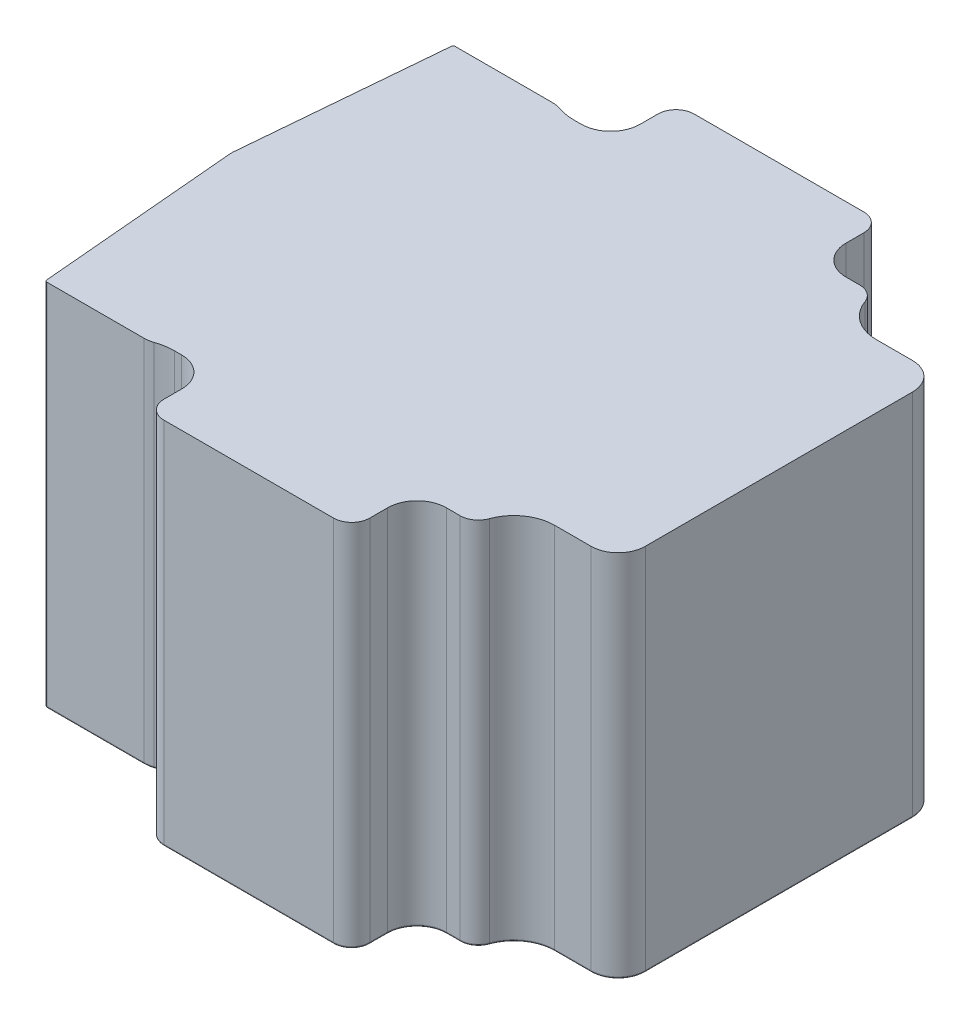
ISO-10303-21;
HEADER;
FILE_DESCRIPTION(('STEP AP214'),'2;1');
FILE_NAME('part.step','',(''),(''),'','','');
FILE_SCHEMA(('AUTOMOTIVE_DESIGN { 1 0 10303 214 1 1 1 1 }'));
ENDSEC;
DATA;
#1=APPLICATION_CONTEXT('core data for automotive mechanical design processes');
#2=APPLICATION_PROTOCOL_DEFINITION('international standard','automotive_design',2000,#1);
#3=PRODUCT_CONTEXT('',#1,'mechanical');
#4=PRODUCT('Part','Part','',(#3));
#5=PRODUCT_RELATED_PRODUCT_CATEGORY('part','',(#4));
#6=PRODUCT_DEFINITION_FORMATION('','',#4);
#7=PRODUCT_DEFINITION_CONTEXT('part definition',#1,'design');
#8=PRODUCT_DEFINITION('design','',#6,#7);
#9=PRODUCT_DEFINITION_SHAPE('','',#8);
#10=(LENGTH_UNIT() NAMED_UNIT(*) SI_UNIT(.MILLI.,.METRE.));
#11=(NAMED_UNIT(*) PLANE_ANGLE_UNIT() SI_UNIT($,.RADIAN.));
#12=(NAMED_UNIT(*) SI_UNIT($,.STERADIAN.) SOLID_ANGLE_UNIT());
#13=UNCERTAINTY_MEASURE_WITH_UNIT(LENGTH_MEASURE(1.E-05),#10,'distance_accuracy_value','');
#14=(GEOMETRIC_REPRESENTATION_CONTEXT(3) GLOBAL_UNCERTAINTY_ASSIGNED_CONTEXT((#13)) GLOBAL_UNIT_ASSIGNED_CONTEXT((#10,
#11,#12)) REPRESENTATION_CONTEXT('',''));
#15=CARTESIAN_POINT('',(0.,0.,0.));
#16=DIRECTION('',(0.,0.,1.));
#17=DIRECTION('',(1.,0.,0.));
#18=AXIS2_PLACEMENT_3D('',#15,#16,#17);
#19=CARTESIAN_POINT('',(29.3,40.,-29.3));
#20=DIRECTION('',(0.,0.,1.));
#21=DIRECTION('',(1.,0.,0.));
#22=AXIS2_PLACEMENT_3D('',#19,#20,#21);
#23=PLANE('',#22);
#24=DIRECTION('',(0.,-1.,0.));
#25=VECTOR('',#24,1.);
#26=CARTESIAN_POINT('',(9.37500000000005,40.,-29.3));
#27=LINE('',#26,#25);
#28=CARTESIAN_POINT('',(9.37500000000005,40.,-29.3));
#29=VERTEX_POINT('',#28);
#30=CARTESIAN_POINT('',(9.37500000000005,-0.600000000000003,-29.3));
#31=VERTEX_POINT('',#30);
#32=EDGE_CURVE('E509',#29,#31,#27,.T.);
#33=ORIENTED_EDGE('',*,*,#32,.T.);
#34=DIRECTION('',(-1.,0.,0.));
#35=VECTOR('',#34,1.);
#36=CARTESIAN_POINT('',(-9.37500000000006,-0.600000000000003,-29.3));
#37=LINE('',#36,#35);
#38=CARTESIAN_POINT('',(-9.37500000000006,-0.600000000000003,-29.3));
#39=VERTEX_POINT('',#38);
#40=EDGE_CURVE('E713',#31,#39,#37,.T.);
#41=ORIENTED_EDGE('',*,*,#40,.T.);
#42=DIRECTION('',(0.,1.,0.));
#43=VECTOR('',#42,1.);
#44=CARTESIAN_POINT('',(-9.37500000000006,40.,-29.3));
#45=LINE('',#44,#43);
#46=CARTESIAN_POINT('',(-9.37500000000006,40.,-29.3));
#47=VERTEX_POINT('',#46);
#48=EDGE_CURVE('E512',#39,#47,#45,.T.);
#49=ORIENTED_EDGE('',*,*,#48,.T.);
#50=DIRECTION('',(-1.,0.,0.));
#51=VECTOR('',#50,1.);
#52=CARTESIAN_POINT('',(29.3,40.,-29.3));
#53=LINE('',#52,#51);
#54=EDGE_CURVE('E474',#29,#47,#53,.T.);
#55=ORIENTED_EDGE('',*,*,#54,.F.);
#56=EDGE_LOOP('',(#33,#41,#49,#55));
#57=FACE_BOUND('',#56,.T.);
#58=ADVANCED_FACE('F17',(#57),#23,.F.);
#59=CARTESIAN_POINT('',(-33.,40.,29.3));
#60=DIRECTION('',(0.,0.,-1.));
#61=DIRECTION('',(-1.,0.,0.));
#62=AXIS2_PLACEMENT_3D('',#59,#60,#61);
#63=PLANE('',#62);
#64=DIRECTION('',(0.,-1.,0.));
#65=VECTOR('',#64,1.);
#66=CARTESIAN_POINT('',(-9.37500000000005,40.,29.3));
#67=LINE('',#66,#65);
#68=CARTESIAN_POINT('',(-9.37500000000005,40.,29.3));
#69=VERTEX_POINT('',#68);
#70=CARTESIAN_POINT('',(-9.37500000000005,-0.600000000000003,29.3));
#71=VERTEX_POINT('',#70);
#72=EDGE_CURVE('E493',#69,#71,#67,.T.);
#73=ORIENTED_EDGE('',*,*,#72,.T.);
#74=DIRECTION('',(1.,0.,0.));
#75=VECTOR('',#74,1.);
#76=CARTESIAN_POINT('',(9.37500000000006,-0.600000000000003,29.3));
#77=LINE('',#76,#75);
#78=CARTESIAN_POINT('',(9.37500000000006,-0.600000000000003,29.3));
#79=VERTEX_POINT('',#78);
#80=EDGE_CURVE('E677',#71,#79,#77,.T.);
#81=ORIENTED_EDGE('',*,*,#80,.T.);
#82=DIRECTION('',(0.,1.,0.));
#83=VECTOR('',#82,1.);
#84=CARTESIAN_POINT('',(9.37500000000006,40.,29.3));
#85=LINE('',#84,#83);
#86=CARTESIAN_POINT('',(9.37500000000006,40.,29.3));
#87=VERTEX_POINT('',#86);
#88=EDGE_CURVE('E491',#79,#87,#85,.T.);
#89=ORIENTED_EDGE('',*,*,#88,.T.);
#90=DIRECTION('',(1.,0.,0.));
#91=VECTOR('',#90,1.);
#92=CARTESIAN_POINT('',(-33.,40.,29.3));
#93=LINE('',#92,#91);
#94=EDGE_CURVE('E485',#69,#87,#93,.T.);
#95=ORIENTED_EDGE('',*,*,#94,.F.);
#96=EDGE_LOOP('',(#73,#81,#89,#95));
#97=FACE_BOUND('',#96,.T.);
#98=ADVANCED_FACE('F910',(#97),#63,.F.);
#99=CARTESIAN_POINT('',(29.3,40.,29.3));
#100=DIRECTION('',(-1.,0.,0.));
#101=DIRECTION('',(0.,0.,1.));
#102=AXIS2_PLACEMENT_3D('',#99,#100,#101);
#103=PLANE('',#102);
#104=DIRECTION('',(0.,1.,0.));
#105=VECTOR('',#104,1.);
#106=CARTESIAN_POINT('',(29.3,-0.800000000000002,14.7738636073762));
#107=LINE('',#106,#105);
#108=CARTESIAN_POINT('',(29.3,-0.600000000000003,14.7738636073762));
#109=VERTEX_POINT('',#108);
#110=CARTESIAN_POINT('',(29.3,40.,14.7738636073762));
#111=VERTEX_POINT('',#110);
#112=EDGE_CURVE('E479',#109,#111,#107,.T.);
#113=ORIENTED_EDGE('',*,*,#112,.F.);
#114=DIRECTION('',(0.,0.,-1.));
#115=VECTOR('',#114,1.);
#116=CARTESIAN_POINT('',(29.3,-0.600000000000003,-14.7738636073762));
#117=LINE('',#116,#115);
#118=CARTESIAN_POINT('',(29.3,-0.6,-14.7738636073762));
#119=VERTEX_POINT('',#118);
#120=EDGE_CURVE('E695',#109,#119,#117,.T.);
#121=ORIENTED_EDGE('',*,*,#120,.T.);
#122=DIRECTION('',(0.,1.,0.));
#123=VECTOR('',#122,1.);
#124=CARTESIAN_POINT('',(29.3,-0.800000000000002,-14.7738636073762));
#125=LINE('',#124,#123);
#126=CARTESIAN_POINT('',(29.3,40.,-14.7738636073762));
#127=VERTEX_POINT('',#126);
#128=EDGE_CURVE('E477',#119,#127,#125,.T.);
#129=ORIENTED_EDGE('',*,*,#128,.T.);
#130=DIRECTION('',(0.,0.,-1.));
#131=VECTOR('',#130,1.);
#132=CARTESIAN_POINT('',(29.3,40.,29.3));
#133=LINE('',#132,#131);
#134=EDGE_CURVE('E488',#111,#127,#133,.T.);
#135=ORIENTED_EDGE('',*,*,#134,.F.);
#136=EDGE_LOOP('',(#113,#121,#129,#135));
#137=FACE_BOUND('',#136,.T.);
#138=ADVANCED_FACE('F916',(#137),#103,.F.);
#139=CARTESIAN_POINT('',(29.3,40.,-29.3));
#140=DIRECTION('',(0.,-1.,0.));
#141=DIRECTION('',(0.,0.,-1.));
#142=AXIS2_PLACEMENT_3D('',#139,#140,#141);
#143=PLANE('',#142);
#144=CARTESIAN_POINT('',(-15.4189230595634,40.,-28.0812430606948));
#145=DIRECTION('',(0.,-1.,0.));
#146=DIRECTION('',(0.,0.,-1.));
#147=AXIS2_PLACEMENT_3D('',#144,#145,#146);
#148=CIRCLE('',#147,6.);
#149=CARTESIAN_POINT('',(-15.4189230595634,40.,-22.0812430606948));
#150=VERTEX_POINT('',#149);
#151=CARTESIAN_POINT('',(-17.3548440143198,40.,-22.4021401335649));
#152=VERTEX_POINT('',#151);
#153=EDGE_CURVE('E560',#150,#152,#148,.T.);
#154=ORIENTED_EDGE('',*,*,#153,.T.);
#155=CARTESIAN_POINT('',(-18.322804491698,40.,-19.56258867));
#156=DIRECTION('',(0.,-1.,0.));
#157=DIRECTION('',(0.,0.,-1.));
#158=AXIS2_PLACEMENT_3D('',#155,#156,#157);
#159=CIRCLE('',#158,3.);
#160=CARTESIAN_POINT('',(-18.322804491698,40.,-22.56258867));
#161=VERTEX_POINT('',#160);
#162=EDGE_CURVE('E566',#152,#161,#159,.F.);
#163=ORIENTED_EDGE('',*,*,#162,.T.);
#164=DIRECTION('',(-1.,0.,0.));
#165=VECTOR('',#164,1.);
#166=CARTESIAN_POINT('',(-17.77358943,40.,-22.56258867));
#167=LINE('',#166,#165);
#168=CARTESIAN_POINT('',(-29.0209173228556,40.,-22.56258867));
#169=VERTEX_POINT('',#168);
#170=EDGE_CURVE('E465',#161,#169,#167,.T.);
#171=ORIENTED_EDGE('',*,*,#170,.T.);
#172=CARTESIAN_POINT('',(-29.0209173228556,40.,-22.31258867));
#173=DIRECTION('',(0.,-1.,0.));
#174=DIRECTION('',(0.,0.,-1.));
#175=AXIS2_PLACEMENT_3D('',#172,#173,#174);
#176=CIRCLE('',#175,0.25);
#177=CARTESIAN_POINT('',(-29.2699659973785,40.,-22.3343776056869));
#178=VERTEX_POINT('',#177);
#179=EDGE_CURVE('E535',#169,#178,#176,.F.);
#180=ORIENTED_EDGE('',*,*,#179,.T.);
#181=DIRECTION('',(0.0871557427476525,0.,-0.996194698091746));
#182=VECTOR('',#181,1.);
#183=CARTESIAN_POINT('',(-29.25,40.,-22.56259));
#184=LINE('',#183,#182);
#185=CARTESIAN_POINT('',(-31.2010954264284,40.,-0.261467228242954));
#186=VERTEX_POINT('',#185);
#187=EDGE_CURVE('E396',#186,#178,#184,.T.);
#188=ORIENTED_EDGE('',*,*,#187,.F.);
#189=CARTESIAN_POINT('',(-28.2125113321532,40.,0.));
#190=DIRECTION('',(0.,-1.,0.));
#191=DIRECTION('',(0.,0.,-1.));
#192=AXIS2_PLACEMENT_3D('',#189,#190,#191);
#193=CIRCLE('',#192,3.);
#194=CARTESIAN_POINT('',(-31.2010954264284,40.,0.261467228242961));
#195=VERTEX_POINT('',#194);
#196=EDGE_CURVE('E548',#186,#195,#193,.F.);
#197=ORIENTED_EDGE('',*,*,#196,.T.);
#198=DIRECTION('',(-0.0871557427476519,0.,-0.996194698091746));
#199=VECTOR('',#198,1.);
#200=CARTESIAN_POINT('',(-29.25,40.,22.56259));
#201=LINE('',#200,#199);
#202=CARTESIAN_POINT('',(-29.2699659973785,40.,22.3343776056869));
#203=VERTEX_POINT('',#202);
#204=EDGE_CURVE('E891',#203,#195,#201,.T.);
#205=ORIENTED_EDGE('',*,*,#204,.F.);
#206=CARTESIAN_POINT('',(-29.0209173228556,40.,22.31258867));
#207=DIRECTION('',(0.,-1.,0.));
#208=DIRECTION('',(0.,0.,-1.));
#209=AXIS2_PLACEMENT_3D('',#206,#207,#208);
#210=CIRCLE('',#209,0.25);
#211=CARTESIAN_POINT('',(-29.0209173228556,40.,22.56258867));
#212=VERTEX_POINT('',#211);
#213=EDGE_CURVE('E533',#203,#212,#210,.F.);
#214=ORIENTED_EDGE('',*,*,#213,.T.);
#215=DIRECTION('',(1.,0.,0.));
#216=VECTOR('',#215,1.);
#217=CARTESIAN_POINT('',(-17.77358943,40.,22.56258867));
#218=LINE('',#217,#216);
#219=CARTESIAN_POINT('',(-18.322804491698,40.,22.56258867));
#220=VERTEX_POINT('',#219);
#221=EDGE_CURVE('E468',#212,#220,#218,.T.);
#222=ORIENTED_EDGE('',*,*,#221,.T.);
#223=CARTESIAN_POINT('',(-18.322804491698,40.,19.56258867));
#224=DIRECTION('',(0.,-1.,0.));
#225=DIRECTION('',(0.,0.,-1.));
#226=AXIS2_PLACEMENT_3D('',#223,#224,#225);
#227=CIRCLE('',#226,3.);
#228=CARTESIAN_POINT('',(-17.3548440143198,40.,22.4021401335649));
#229=VERTEX_POINT('',#228);
#230=EDGE_CURVE('E564',#220,#229,#227,.F.);
#231=ORIENTED_EDGE('',*,*,#230,.T.);
#232=CARTESIAN_POINT('',(-15.4189230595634,40.,28.0812430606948));
#233=DIRECTION('',(0.,-1.,0.));
#234=DIRECTION('',(0.,0.,-1.));
#235=AXIS2_PLACEMENT_3D('',#232,#233,#234);
#236=CIRCLE('',#235,6.);
#237=CARTESIAN_POINT('',(-15.4189230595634,40.,22.0812430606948));
#238=VERTEX_POINT('',#237);
#239=EDGE_CURVE('E558',#229,#238,#236,.T.);
#240=ORIENTED_EDGE('',*,*,#239,.T.);
#241=DIRECTION('',(-1.,0.,0.));
#242=VECTOR('',#241,1.);
#243=CARTESIAN_POINT('',(-17.77358943,40.,22.0812430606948));
#244=LINE('',#243,#242);
#245=CARTESIAN_POINT('',(-14.625,40.,22.0812430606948));
#246=VERTEX_POINT('',#245);
#247=EDGE_CURVE('E411',#246,#238,#244,.T.);
#248=ORIENTED_EDGE('',*,*,#247,.F.);
#249=CARTESIAN_POINT('',(-14.6250000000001,40.,25.3312430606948));
#250=DIRECTION('',(0.,1.,0.));
#251=DIRECTION('',(0.,0.,1.));
#252=AXIS2_PLACEMENT_3D('',#249,#250,#251);
#253=CIRCLE('',#252,3.25);
#254=CARTESIAN_POINT('',(-11.375,40.,25.3312430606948));
#255=VERTEX_POINT('',#254);
#256=EDGE_CURVE('E407',#255,#246,#253,.T.);
#257=ORIENTED_EDGE('',*,*,#256,.F.);
#258=DIRECTION('',(0.,0.,-1.));
#259=VECTOR('',#258,1.);
#260=CARTESIAN_POINT('',(-11.375,40.,32.8001981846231));
#261=LINE('',#260,#259);
#262=CARTESIAN_POINT('',(-11.375,40.,27.3));
#263=VERTEX_POINT('',#262);
#264=EDGE_CURVE('E414',#263,#255,#261,.T.);
#265=ORIENTED_EDGE('',*,*,#264,.F.);
#266=CARTESIAN_POINT('',(-9.37500000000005,40.,27.3));
#267=DIRECTION('',(0.,-1.,0.));
#268=DIRECTION('',(0.,0.,-1.));
#269=AXIS2_PLACEMENT_3D('',#266,#267,#268);
#270=CIRCLE('',#269,2.);
#271=EDGE_CURVE('E507',#263,#69,#270,.F.);
#272=ORIENTED_EDGE('',*,*,#271,.T.);
#273=ORIENTED_EDGE('',*,*,#94,.T.);
#274=CARTESIAN_POINT('',(9.37500000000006,40.,27.3));
#275=DIRECTION('',(0.,-1.,0.));
#276=DIRECTION('',(0.,0.,-1.));
#277=AXIS2_PLACEMENT_3D('',#274,#275,#276);
#278=CIRCLE('',#277,2.);
#279=CARTESIAN_POINT('',(11.3750000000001,40.,27.3));
#280=VERTEX_POINT('',#279);
#281=EDGE_CURVE('E498',#87,#280,#278,.F.);
#282=ORIENTED_EDGE('',*,*,#281,.T.);
#283=DIRECTION('',(0.,0.,1.));
#284=VECTOR('',#283,1.);
#285=CARTESIAN_POINT('',(11.3750000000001,40.,32.8001981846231));
#286=LINE('',#285,#284);
#287=CARTESIAN_POINT('',(11.3750000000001,40.,25.3312430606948));
#288=VERTEX_POINT('',#287);
#289=EDGE_CURVE('E424',#288,#280,#286,.T.);
#290=ORIENTED_EDGE('',*,*,#289,.F.);
#291=CARTESIAN_POINT('',(14.6250000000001,40.,25.3312430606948));
#292=DIRECTION('',(0.,1.,0.));
#293=DIRECTION('',(0.,0.,-1.));
#294=AXIS2_PLACEMENT_3D('',#291,#292,#293);
#295=CIRCLE('',#294,3.25);
#296=CARTESIAN_POINT('',(14.6250000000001,40.,22.0812430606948));
#297=VERTEX_POINT('',#296);
#298=EDGE_CURVE('E420',#297,#288,#295,.T.);
#299=ORIENTED_EDGE('',*,*,#298,.F.);
#300=DIRECTION('',(-1.,0.,0.));
#301=VECTOR('',#300,1.);
#302=CARTESIAN_POINT('',(17.77358943,40.,22.0812430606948));
#303=LINE('',#302,#301);
#304=CARTESIAN_POINT('',(16.1548428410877,40.,22.0812430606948));
#305=VERTEX_POINT('',#304);
#306=EDGE_CURVE('E427',#305,#297,#303,.T.);
#307=ORIENTED_EDGE('',*,*,#306,.F.);
#308=CARTESIAN_POINT('',(16.1548428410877,40.,20.0812430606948));
#309=DIRECTION('',(0.,-1.,0.));
#310=DIRECTION('',(0.,0.,-1.));
#311=AXIS2_PLACEMENT_3D('',#308,#309,#310);
#312=CIRCLE('',#311,2.);
#313=CARTESIAN_POINT('',(18.0376184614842,40.,20.7558955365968));
#314=VERTEX_POINT('',#313);
#315=EDGE_CURVE('E500',#305,#314,#312,.F.);
#316=ORIENTED_EDGE('',*,*,#315,.T.);
#317=CARTESIAN_POINT('',(22.2738636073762,40.,22.2738636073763));
#318=DIRECTION('',(0.,-1.,0.));
#319=DIRECTION('',(0.,0.,-1.));
#320=AXIS2_PLACEMENT_3D('',#317,#318,#319);
#321=CIRCLE('',#320,4.5);
#322=CARTESIAN_POINT('',(22.2738636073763,40.,17.7738636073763));
#323=VERTEX_POINT('',#322);
#324=EDGE_CURVE('E446',#314,#323,#321,.T.);
#325=ORIENTED_EDGE('',*,*,#324,.T.);
#326=DIRECTION('',(1.,0.,0.));
#327=VECTOR('',#326,1.);
#328=CARTESIAN_POINT('',(22.2738636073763,40.,17.7738636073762));
#329=LINE('',#328,#327);
#330=CARTESIAN_POINT('',(26.3,40.,17.7738636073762));
#331=VERTEX_POINT('',#330);
#332=EDGE_CURVE('E450',#323,#331,#329,.T.);
#333=ORIENTED_EDGE('',*,*,#332,.T.);
#334=CARTESIAN_POINT('',(26.3,40.,14.7738636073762));
#335=DIRECTION('',(0.,1.,0.));
#336=DIRECTION('',(0.,0.,-1.));
#337=AXIS2_PLACEMENT_3D('',#334,#335,#336);
#338=CIRCLE('',#337,3.);
#339=EDGE_CURVE('E453',#331,#111,#338,.T.);
#340=ORIENTED_EDGE('',*,*,#339,.T.);
#341=ORIENTED_EDGE('',*,*,#134,.T.);
#342=CARTESIAN_POINT('',(26.3,40.,-14.7738636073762));
#343=DIRECTION('',(0.,1.,0.));
#344=DIRECTION('',(0.,0.,1.));
#345=AXIS2_PLACEMENT_3D('',#342,#343,#344);
#346=CIRCLE('',#345,3.);
#347=CARTESIAN_POINT('',(26.3,40.,-17.7738636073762));
#348=VERTEX_POINT('',#347);
#349=EDGE_CURVE('E456',#127,#348,#346,.T.);
#350=ORIENTED_EDGE('',*,*,#349,.T.);
#351=DIRECTION('',(-1.,0.,0.));
#352=VECTOR('',#351,1.);
#353=CARTESIAN_POINT('',(22.2738636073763,40.,-17.7738636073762));
#354=LINE('',#353,#352);
#355=CARTESIAN_POINT('',(22.2738636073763,40.,-17.7738636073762));
#356=VERTEX_POINT('',#355);
#357=EDGE_CURVE('E459',#348,#356,#354,.T.);
#358=ORIENTED_EDGE('',*,*,#357,.T.);
#359=CARTESIAN_POINT('',(22.2738636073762,40.,-22.2738636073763));
#360=DIRECTION('',(0.,-1.,0.));
#361=DIRECTION('',(0.,0.,1.));
#362=AXIS2_PLACEMENT_3D('',#359,#360,#361);
#363=CIRCLE('',#362,4.5);
#364=CARTESIAN_POINT('',(18.0376184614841,40.,-20.7558955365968));
#365=VERTEX_POINT('',#364);
#366=EDGE_CURVE('E462',#356,#365,#363,.T.);
#367=ORIENTED_EDGE('',*,*,#366,.T.);
#368=CARTESIAN_POINT('',(16.1548428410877,40.,-20.0812430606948));
#369=DIRECTION('',(0.,-1.,0.));
#370=DIRECTION('',(0.,0.,-1.));
#371=AXIS2_PLACEMENT_3D('',#368,#369,#370);
#372=CIRCLE('',#371,2.);
#373=CARTESIAN_POINT('',(16.1548428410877,40.,-22.0812430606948));
#374=VERTEX_POINT('',#373);
#375=EDGE_CURVE('E504',#365,#374,#372,.F.);
#376=ORIENTED_EDGE('',*,*,#375,.T.);
#377=DIRECTION('',(1.,0.,0.));
#378=VECTOR('',#377,1.);
#379=CARTESIAN_POINT('',(17.77358943,40.,-22.0812430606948));
#380=LINE('',#379,#378);
#381=CARTESIAN_POINT('',(14.625,40.,-22.0812430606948));
#382=VERTEX_POINT('',#381);
#383=EDGE_CURVE('E440',#382,#374,#380,.T.);
#384=ORIENTED_EDGE('',*,*,#383,.F.);
#385=CARTESIAN_POINT('',(14.625,40.,-25.3312430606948));
#386=DIRECTION('',(0.,1.,0.));
#387=DIRECTION('',(0.,0.,1.));
#388=AXIS2_PLACEMENT_3D('',#385,#386,#387);
#389=CIRCLE('',#388,3.25);
#390=CARTESIAN_POINT('',(11.375,40.,-25.3312430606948));
#391=VERTEX_POINT('',#390);
#392=EDGE_CURVE('E437',#391,#382,#389,.T.);
#393=ORIENTED_EDGE('',*,*,#392,.F.);
#394=DIRECTION('',(0.,0.,1.));
#395=VECTOR('',#394,1.);
#396=CARTESIAN_POINT('',(11.375,40.,-32.8001981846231));
#397=LINE('',#396,#395);
#398=CARTESIAN_POINT('',(11.375,40.,-27.3));
#399=VERTEX_POINT('',#398);
#400=EDGE_CURVE('E433',#399,#391,#397,.T.);
#401=ORIENTED_EDGE('',*,*,#400,.F.);
#402=CARTESIAN_POINT('',(9.37500000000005,40.,-27.3));
#403=DIRECTION('',(0.,-1.,0.));
#404=DIRECTION('',(0.,0.,-1.));
#405=AXIS2_PLACEMENT_3D('',#402,#403,#404);
#406=CIRCLE('',#405,2.);
#407=EDGE_CURVE('E502',#399,#29,#406,.F.);
#408=ORIENTED_EDGE('',*,*,#407,.T.);
#409=ORIENTED_EDGE('',*,*,#54,.T.);
#410=CARTESIAN_POINT('',(-9.37500000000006,40.,-27.3));
#411=DIRECTION('',(0.,-1.,0.));
#412=DIRECTION('',(0.,0.,-1.));
#413=AXIS2_PLACEMENT_3D('',#410,#411,#412);
#414=CIRCLE('',#413,2.);
#415=CARTESIAN_POINT('',(-11.3750000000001,40.,-27.3));
#416=VERTEX_POINT('',#415);
#417=EDGE_CURVE('E402',#47,#416,#414,.F.);
#418=ORIENTED_EDGE('',*,*,#417,.T.);
#419=DIRECTION('',(0.,0.,-1.));
#420=VECTOR('',#419,1.);
#421=CARTESIAN_POINT('',(-11.3750000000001,40.,-32.8001981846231));
#422=LINE('',#421,#420);
#423=CARTESIAN_POINT('',(-11.3750000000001,40.,-25.3312430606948));
#424=VERTEX_POINT('',#423);
#425=EDGE_CURVE('E380',#424,#416,#422,.T.);
#426=ORIENTED_EDGE('',*,*,#425,.F.);
#427=CARTESIAN_POINT('',(-14.625,40.,-25.3312430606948));
#428=DIRECTION('',(0.,1.,0.));
#429=DIRECTION('',(0.,0.,-1.));
#430=AXIS2_PLACEMENT_3D('',#427,#428,#429);
#431=CIRCLE('',#430,3.25);
#432=CARTESIAN_POINT('',(-14.625,40.,-22.0812430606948));
#433=VERTEX_POINT('',#432);
#434=EDGE_CURVE('E390',#433,#424,#431,.T.);
#435=ORIENTED_EDGE('',*,*,#434,.F.);
#436=DIRECTION('',(1.,0.,0.));
#437=VECTOR('',#436,1.);
#438=CARTESIAN_POINT('',(-17.77358943,40.,-22.0812430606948));
#439=LINE('',#438,#437);
#440=EDGE_CURVE('E387',#150,#433,#439,.T.);
#441=ORIENTED_EDGE('',*,*,#440,.F.);
#442=EDGE_LOOP('',(#154,#163,#171,#180,#188,#197,#205,#214,#222,#231,#240,#248,#257,#265,#272,
#273,#282,#290,#299,#307,#316,#325,#333,#340,#341,#350,#358,#367,#376,#384,#393,#401,#408,#409,
#418,#426,#435,#441));
#443=FACE_BOUND('',#442,.T.);
#444=ADVANCED_FACE('F399',(#443),#143,.F.);
#445=CARTESIAN_POINT('',(29.3,-0.8,-29.3));
#446=DIRECTION('',(0.,-1.,0.));
#447=DIRECTION('',(0.,0.,-1.));
#448=AXIS2_PLACEMENT_3D('',#445,#446,#447);
#449=PLANE('',#448);
#450=DIRECTION('',(0.0871557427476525,0.,-0.996194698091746));
#451=VECTOR('',#450,1.);
#452=CARTESIAN_POINT('',(-29.0707270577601,-0.8,-22.3169464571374));
#453=LINE('',#452,#451);
#454=CARTESIAN_POINT('',(-31.0018564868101,-0.8,-0.244036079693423));
#455=VERTEX_POINT('',#454);
#456=CARTESIAN_POINT('',(-29.0707270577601,-0.8,-22.3169464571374));
#457=VERTEX_POINT('',#456);
#458=EDGE_CURVE('E647',#455,#457,#453,.T.);
#459=ORIENTED_EDGE('',*,*,#458,.T.);
#460=CARTESIAN_POINT('',(-29.0209173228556,-0.8,-22.31258867));
#461=DIRECTION('',(0.,-1.,0.));
#462=DIRECTION('',(0.,0.,-1.));
#463=AXIS2_PLACEMENT_3D('',#460,#461,#462);
#464=CIRCLE('',#463,0.05);
#465=CARTESIAN_POINT('',(-29.0209173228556,-0.8,-22.36258867));
#466=VERTEX_POINT('',#465);
#467=EDGE_CURVE('E649',#457,#466,#464,.T.);
#468=ORIENTED_EDGE('',*,*,#467,.T.);
#469=DIRECTION('',(-1.,0.,0.));
#470=VECTOR('',#469,1.);
#471=CARTESIAN_POINT('',(29.3,-0.8,-22.36258867));
#472=LINE('',#471,#470);
#473=CARTESIAN_POINT('',(-18.322804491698,-0.8,-22.36258867));
#474=VERTEX_POINT('',#473);
#475=EDGE_CURVE('E575',#466,#474,#472,.F.);
#476=ORIENTED_EDGE('',*,*,#475,.T.);
#477=CARTESIAN_POINT('',(-18.322804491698,-0.8,-19.56258867));
#478=DIRECTION('',(0.,-1.,0.));
#479=DIRECTION('',(0.,0.,-1.));
#480=AXIS2_PLACEMENT_3D('',#477,#478,#479);
#481=CIRCLE('',#480,2.8);
#482=CARTESIAN_POINT('',(-17.4193747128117,-0.8,-22.2128367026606));
#483=VERTEX_POINT('',#482);
#484=EDGE_CURVE('E577',#474,#483,#481,.T.);
#485=ORIENTED_EDGE('',*,*,#484,.T.);
#486=CARTESIAN_POINT('',(-15.4189230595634,-0.8,-28.0812430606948));
#487=DIRECTION('',(0.,-1.,0.));
#488=DIRECTION('',(0.,0.,-1.));
#489=AXIS2_PLACEMENT_3D('',#486,#487,#488);
#490=CIRCLE('',#489,6.2);
#491=CARTESIAN_POINT('',(-15.4189230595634,-0.8,-21.8812430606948));
#492=VERTEX_POINT('',#491);
#493=EDGE_CURVE('E579',#483,#492,#490,.F.);
#494=ORIENTED_EDGE('',*,*,#493,.T.);
#495=DIRECTION('',(1.,0.,0.));
#496=VECTOR('',#495,1.);
#497=CARTESIAN_POINT('',(-14.625,-0.8,-21.8812430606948));
#498=LINE('',#497,#496);
#499=CARTESIAN_POINT('',(-14.625,-0.8,-21.8812430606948));
#500=VERTEX_POINT('',#499);
#501=EDGE_CURVE('E581',#492,#500,#498,.T.);
#502=ORIENTED_EDGE('',*,*,#501,.T.);
#503=CARTESIAN_POINT('',(-14.625,-0.8,-25.3312430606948));
#504=DIRECTION('',(0.,-1.,0.));
#505=DIRECTION('',(0.,0.,-1.));
#506=AXIS2_PLACEMENT_3D('',#503,#504,#505);
#507=CIRCLE('',#506,3.45);
#508=CARTESIAN_POINT('',(-11.175,-0.8,-25.3312430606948));
#509=VERTEX_POINT('',#508);
#510=EDGE_CURVE('E583',#500,#509,#507,.F.);
#511=ORIENTED_EDGE('',*,*,#510,.T.);
#512=DIRECTION('',(0.,0.,-1.));
#513=VECTOR('',#512,1.);
#514=CARTESIAN_POINT('',(-11.1750000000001,-0.8,-27.3));
#515=LINE('',#514,#513);
#516=CARTESIAN_POINT('',(-11.1750000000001,-0.8,-27.3));
#517=VERTEX_POINT('',#516);
#518=EDGE_CURVE('E585',#509,#517,#515,.T.);
#519=ORIENTED_EDGE('',*,*,#518,.T.);
#520=CARTESIAN_POINT('',(-9.37500000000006,-0.8,-27.3));
#521=DIRECTION('',(0.,-1.,0.));
#522=DIRECTION('',(0.,0.,-1.));
#523=AXIS2_PLACEMENT_3D('',#520,#521,#522);
#524=CIRCLE('',#523,1.8);
#525=CARTESIAN_POINT('',(-9.37500000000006,-0.8,-29.1));
#526=VERTEX_POINT('',#525);
#527=EDGE_CURVE('E587',#517,#526,#524,.T.);
#528=ORIENTED_EDGE('',*,*,#527,.T.);
#529=DIRECTION('',(-1.,0.,0.));
#530=VECTOR('',#529,1.);
#531=CARTESIAN_POINT('',(9.37500000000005,-0.8,-29.1));
#532=LINE('',#531,#530);
#533=CARTESIAN_POINT('',(9.37500000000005,-0.8,-29.1));
#534=VERTEX_POINT('',#533);
#535=EDGE_CURVE('E589',#526,#534,#532,.F.);
#536=ORIENTED_EDGE('',*,*,#535,.T.);
#537=CARTESIAN_POINT('',(9.37500000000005,-0.8,-27.3));
#538=DIRECTION('',(0.,-1.,0.));
#539=DIRECTION('',(0.,0.,-1.));
#540=AXIS2_PLACEMENT_3D('',#537,#538,#539);
#541=CIRCLE('',#540,1.8);
#542=CARTESIAN_POINT('',(11.175,-0.8,-27.3));
#543=VERTEX_POINT('',#542);
#544=EDGE_CURVE('E591',#534,#543,#541,.T.);
#545=ORIENTED_EDGE('',*,*,#544,.T.);
#546=DIRECTION('',(0.,0.,1.));
#547=VECTOR('',#546,1.);
#548=CARTESIAN_POINT('',(11.175,-0.8,-25.3312430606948));
#549=LINE('',#548,#547);
#550=CARTESIAN_POINT('',(11.175,-0.8,-25.3312430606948));
#551=VERTEX_POINT('',#550);
#552=EDGE_CURVE('E593',#543,#551,#549,.T.);
#553=ORIENTED_EDGE('',*,*,#552,.T.);
#554=CARTESIAN_POINT('',(14.625,-0.8,-25.3312430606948));
#555=DIRECTION('',(0.,-1.,0.));
#556=DIRECTION('',(0.,0.,-1.));
#557=AXIS2_PLACEMENT_3D('',#554,#555,#556);
#558=CIRCLE('',#557,3.45);
#559=CARTESIAN_POINT('',(14.625,-0.8,-21.8812430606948));
#560=VERTEX_POINT('',#559);
#561=EDGE_CURVE('E595',#551,#560,#558,.F.);
#562=ORIENTED_EDGE('',*,*,#561,.T.);
#563=DIRECTION('',(1.,0.,0.));
#564=VECTOR('',#563,1.);
#565=CARTESIAN_POINT('',(16.1548428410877,-0.8,-21.8812430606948));
#566=LINE('',#565,#564);
#567=CARTESIAN_POINT('',(16.1548428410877,-0.8,-21.8812430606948));
#568=VERTEX_POINT('',#567);
#569=EDGE_CURVE('E597',#560,#568,#566,.T.);
#570=ORIENTED_EDGE('',*,*,#569,.T.);
#571=CARTESIAN_POINT('',(16.1548428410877,-0.8,-20.0812430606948));
#572=DIRECTION('',(0.,-1.,0.));
#573=DIRECTION('',(0.,0.,-1.));
#574=AXIS2_PLACEMENT_3D('',#571,#572,#573);
#575=CIRCLE('',#574,1.8);
#576=CARTESIAN_POINT('',(17.8493408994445,-0.8,-20.6884302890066));
#577=VERTEX_POINT('',#576);
#578=EDGE_CURVE('E599',#568,#577,#575,.T.);
#579=ORIENTED_EDGE('',*,*,#578,.T.);
#580=CARTESIAN_POINT('',(22.2738636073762,-0.8,-22.2738636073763));
#581=DIRECTION('',(0.,-1.,0.));
#582=DIRECTION('',(0.,0.,-1.));
#583=AXIS2_PLACEMENT_3D('',#580,#581,#582);
#584=CIRCLE('',#583,4.7);
#585=CARTESIAN_POINT('',(22.2738636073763,-0.8,-17.5738636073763));
#586=VERTEX_POINT('',#585);
#587=EDGE_CURVE('E601',#577,#586,#584,.F.);
#588=ORIENTED_EDGE('',*,*,#587,.T.);
#589=DIRECTION('',(-1.,0.,0.));
#590=VECTOR('',#589,1.);
#591=CARTESIAN_POINT('',(29.3,-0.8,-17.5738636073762));
#592=LINE('',#591,#590);
#593=CARTESIAN_POINT('',(26.3,-0.8,-17.5738636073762));
#594=VERTEX_POINT('',#593);
#595=EDGE_CURVE('E603',#586,#594,#592,.F.);
#596=ORIENTED_EDGE('',*,*,#595,.T.);
#597=CARTESIAN_POINT('',(26.3,-0.8,-14.7738636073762));
#598=DIRECTION('',(0.,-1.,0.));
#599=DIRECTION('',(0.,0.,-1.));
#600=AXIS2_PLACEMENT_3D('',#597,#598,#599);
#601=CIRCLE('',#600,2.8);
#602=CARTESIAN_POINT('',(29.1,-0.8,-14.7738636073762));
#603=VERTEX_POINT('',#602);
#604=EDGE_CURVE('E605',#594,#603,#601,.T.);
#605=ORIENTED_EDGE('',*,*,#604,.T.);
#606=DIRECTION('',(0.,0.,-1.));
#607=VECTOR('',#606,1.);
#608=CARTESIAN_POINT('',(29.1,-0.8,14.7738636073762));
#609=LINE('',#608,#607);
#610=CARTESIAN_POINT('',(29.1,-0.8,14.7738636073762));
#611=VERTEX_POINT('',#610);
#612=EDGE_CURVE('E607',#603,#611,#609,.F.);
#613=ORIENTED_EDGE('',*,*,#612,.T.);
#614=CARTESIAN_POINT('',(26.3,-0.8,14.7738636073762));
#615=DIRECTION('',(0.,-1.,0.));
#616=DIRECTION('',(0.,0.,-1.));
#617=AXIS2_PLACEMENT_3D('',#614,#615,#616);
#618=CIRCLE('',#617,2.8);
#619=CARTESIAN_POINT('',(26.3,-0.8,17.5738636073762));
#620=VERTEX_POINT('',#619);
#621=EDGE_CURVE('E609',#611,#620,#618,.T.);
#622=ORIENTED_EDGE('',*,*,#621,.T.);
#623=DIRECTION('',(1.,0.,0.));
#624=VECTOR('',#623,1.);
#625=CARTESIAN_POINT('',(29.3,-0.8,17.5738636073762));
#626=LINE('',#625,#624);
#627=CARTESIAN_POINT('',(22.2738636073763,-0.8,17.5738636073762));
#628=VERTEX_POINT('',#627);
#629=EDGE_CURVE('E611',#620,#628,#626,.F.);
#630=ORIENTED_EDGE('',*,*,#629,.T.);
#631=CARTESIAN_POINT('',(22.2738636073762,-0.8,22.2738636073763));
#632=DIRECTION('',(0.,-1.,0.));
#633=DIRECTION('',(0.,0.,-1.));
#634=AXIS2_PLACEMENT_3D('',#631,#632,#633);
#635=CIRCLE('',#634,4.7);
#636=CARTESIAN_POINT('',(17.8493408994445,-0.8,20.6884302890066));
#637=VERTEX_POINT('',#636);
#638=EDGE_CURVE('E613',#628,#637,#635,.F.);
#639=ORIENTED_EDGE('',*,*,#638,.T.);
#640=CARTESIAN_POINT('',(16.1548428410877,-0.8,20.0812430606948));
#641=DIRECTION('',(0.,-1.,0.));
#642=DIRECTION('',(0.,0.,-1.));
#643=AXIS2_PLACEMENT_3D('',#640,#641,#642);
#644=CIRCLE('',#643,1.8);
#645=CARTESIAN_POINT('',(16.1548428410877,-0.8,21.8812430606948));
#646=VERTEX_POINT('',#645);
#647=EDGE_CURVE('E615',#637,#646,#644,.T.);
#648=ORIENTED_EDGE('',*,*,#647,.T.);
#649=DIRECTION('',(-1.,0.,0.));
#650=VECTOR('',#649,1.);
#651=CARTESIAN_POINT('',(14.6250000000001,-0.8,21.8812430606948));
#652=LINE('',#651,#650);
#653=CARTESIAN_POINT('',(14.6250000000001,-0.8,21.8812430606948));
#654=VERTEX_POINT('',#653);
#655=EDGE_CURVE('E617',#646,#654,#652,.T.);
#656=ORIENTED_EDGE('',*,*,#655,.T.);
#657=CARTESIAN_POINT('',(14.6250000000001,-0.8,25.3312430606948));
#658=DIRECTION('',(0.,-1.,0.));
#659=DIRECTION('',(0.,0.,-1.));
#660=AXIS2_PLACEMENT_3D('',#657,#658,#659);
#661=CIRCLE('',#660,3.45);
#662=CARTESIAN_POINT('',(11.1750000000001,-0.8,25.3312430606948));
#663=VERTEX_POINT('',#662);
#664=EDGE_CURVE('E619',#654,#663,#661,.F.);
#665=ORIENTED_EDGE('',*,*,#664,.T.);
#666=DIRECTION('',(0.,0.,1.));
#667=VECTOR('',#666,1.);
#668=CARTESIAN_POINT('',(11.1750000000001,-0.8,27.3));
#669=LINE('',#668,#667);
#670=CARTESIAN_POINT('',(11.1750000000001,-0.8,27.3));
#671=VERTEX_POINT('',#670);
#672=EDGE_CURVE('E621',#663,#671,#669,.T.);
#673=ORIENTED_EDGE('',*,*,#672,.T.);
#674=CARTESIAN_POINT('',(9.37500000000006,-0.8,27.3));
#675=DIRECTION('',(0.,-1.,0.));
#676=DIRECTION('',(0.,0.,-1.));
#677=AXIS2_PLACEMENT_3D('',#674,#675,#676);
#678=CIRCLE('',#677,1.8);
#679=CARTESIAN_POINT('',(9.37500000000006,-0.8,29.1));
#680=VERTEX_POINT('',#679);
#681=EDGE_CURVE('E623',#671,#680,#678,.T.);
#682=ORIENTED_EDGE('',*,*,#681,.T.);
#683=DIRECTION('',(1.,0.,0.));
#684=VECTOR('',#683,1.);
#685=CARTESIAN_POINT('',(-9.37500000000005,-0.8,29.1));
#686=LINE('',#685,#684);
#687=CARTESIAN_POINT('',(-9.37500000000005,-0.8,29.1));
#688=VERTEX_POINT('',#687);
#689=EDGE_CURVE('E625',#680,#688,#686,.F.);
#690=ORIENTED_EDGE('',*,*,#689,.T.);
#691=CARTESIAN_POINT('',(-9.37500000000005,-0.8,27.3));
#692=DIRECTION('',(0.,-1.,0.));
#693=DIRECTION('',(0.,0.,-1.));
#694=AXIS2_PLACEMENT_3D('',#691,#692,#693);
#695=CIRCLE('',#694,1.8);
#696=CARTESIAN_POINT('',(-11.175,-0.8,27.3));
#697=VERTEX_POINT('',#696);
#698=EDGE_CURVE('E627',#688,#697,#695,.T.);
#699=ORIENTED_EDGE('',*,*,#698,.T.);
#700=DIRECTION('',(0.,0.,-1.));
#701=VECTOR('',#700,1.);
#702=CARTESIAN_POINT('',(-11.175,-0.8,25.3312430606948));
#703=LINE('',#702,#701);
#704=CARTESIAN_POINT('',(-11.175,-0.8,25.3312430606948));
#705=VERTEX_POINT('',#704);
#706=EDGE_CURVE('E629',#697,#705,#703,.T.);
#707=ORIENTED_EDGE('',*,*,#706,.T.);
#708=CARTESIAN_POINT('',(-14.6250000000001,-0.8,25.3312430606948));
#709=DIRECTION('',(0.,-1.,0.));
#710=DIRECTION('',(0.,0.,-1.));
#711=AXIS2_PLACEMENT_3D('',#708,#709,#710);
#712=CIRCLE('',#711,3.45);
#713=CARTESIAN_POINT('',(-14.625,-0.8,21.8812430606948));
#714=VERTEX_POINT('',#713);
#715=EDGE_CURVE('E631',#705,#714,#712,.F.);
#716=ORIENTED_EDGE('',*,*,#715,.T.);
#717=DIRECTION('',(-1.,0.,0.));
#718=VECTOR('',#717,1.);
#719=CARTESIAN_POINT('',(-15.4189230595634,-0.8,21.8812430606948));
#720=LINE('',#719,#718);
#721=CARTESIAN_POINT('',(-15.4189230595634,-0.8,21.8812430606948));
#722=VERTEX_POINT('',#721);
#723=EDGE_CURVE('E633',#714,#722,#720,.T.);
#724=ORIENTED_EDGE('',*,*,#723,.T.);
#725=CARTESIAN_POINT('',(-15.4189230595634,-0.8,28.0812430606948));
#726=DIRECTION('',(0.,-1.,0.));
#727=DIRECTION('',(0.,0.,-1.));
#728=AXIS2_PLACEMENT_3D('',#725,#726,#727);
#729=CIRCLE('',#728,6.2);
#730=CARTESIAN_POINT('',(-17.4193747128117,-0.8,22.2128367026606));
#731=VERTEX_POINT('',#730);
#732=EDGE_CURVE('E635',#722,#731,#729,.F.);
#733=ORIENTED_EDGE('',*,*,#732,.T.);
#734=CARTESIAN_POINT('',(-18.322804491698,-0.8,19.56258867));
#735=DIRECTION('',(0.,-1.,0.));
#736=DIRECTION('',(0.,0.,-1.));
#737=AXIS2_PLACEMENT_3D('',#734,#735,#736);
#738=CIRCLE('',#737,2.8);
#739=CARTESIAN_POINT('',(-18.322804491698,-0.8,22.36258867));
#740=VERTEX_POINT('',#739);
#741=EDGE_CURVE('E637',#731,#740,#738,.T.);
#742=ORIENTED_EDGE('',*,*,#741,.T.);
#743=DIRECTION('',(1.,0.,0.));
#744=VECTOR('',#743,1.);
#745=CARTESIAN_POINT('',(29.3,-0.8,22.36258867));
#746=LINE('',#745,#744);
#747=CARTESIAN_POINT('',(-29.0209173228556,-0.8,22.36258867));
#748=VERTEX_POINT('',#747);
#749=EDGE_CURVE('E639',#740,#748,#746,.F.);
#750=ORIENTED_EDGE('',*,*,#749,.T.);
#751=CARTESIAN_POINT('',(-29.0209173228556,-0.8,22.31258867));
#752=DIRECTION('',(0.,-1.,0.));
#753=DIRECTION('',(0.,0.,-1.));
#754=AXIS2_PLACEMENT_3D('',#751,#752,#753);
#755=CIRCLE('',#754,0.05);
#756=CARTESIAN_POINT('',(-29.0707270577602,-0.8,22.3169464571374));
#757=VERTEX_POINT('',#756);
#758=EDGE_CURVE('E641',#748,#757,#755,.T.);
#759=ORIENTED_EDGE('',*,*,#758,.T.);
#760=DIRECTION('',(-0.0871557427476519,0.,-0.996194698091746));
#761=VECTOR('',#760,1.);
#762=CARTESIAN_POINT('',(-31.0018564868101,-0.8,0.244036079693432));
#763=LINE('',#762,#761);
#764=CARTESIAN_POINT('',(-31.0018564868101,-0.8,0.24403607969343));
#765=VERTEX_POINT('',#764);
#766=EDGE_CURVE('E643',#757,#765,#763,.T.);
#767=ORIENTED_EDGE('',*,*,#766,.T.);
#768=CARTESIAN_POINT('',(-28.2125113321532,-0.8,0.));
#769=DIRECTION('',(0.,-1.,0.));
#770=DIRECTION('',(0.,0.,-1.));
#771=AXIS2_PLACEMENT_3D('',#768,#769,#770);
#772=CIRCLE('',#771,2.8);
#773=EDGE_CURVE('E645',#765,#455,#772,.T.);
#774=ORIENTED_EDGE('',*,*,#773,.T.);
#775=EDGE_LOOP('',(#459,#468,#476,#485,#494,#502,#511,#519,#528,#536,#545,#553,#562,#570,#579,
#588,#596,#605,#613,#622,#630,#639,#648,#656,#665,#673,#682,#690,#699,#707,#716,#724,#733,#742,
#750,#759,#767,#774));
#776=FACE_BOUND('',#775,.T.);
#777=ADVANCED_FACE('F953',(#776),#449,.T.);
#778=CARTESIAN_POINT('',(22.2738636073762,-0.800000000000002,22.2738636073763));
#779=DIRECTION('',(0.,1.,0.));
#780=DIRECTION('',(0.,0.,1.));
#781=AXIS2_PLACEMENT_3D('',#778,#779,#780);
#782=CYLINDRICAL_SURFACE('',#781,4.5);
#783=DIRECTION('',(0.,1.,0.));
#784=VECTOR('',#783,1.);
#785=CARTESIAN_POINT('',(18.0376184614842,-0.800000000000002,20.7558955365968));
#786=LINE('',#785,#784);
#787=CARTESIAN_POINT('',(18.0376184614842,-0.6,20.7558955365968));
#788=VERTEX_POINT('',#787);
#789=EDGE_CURVE('E525',#314,#788,#786,.F.);
#790=ORIENTED_EDGE('',*,*,#789,.T.);
#791=CARTESIAN_POINT('',(22.2738636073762,-0.6,22.2738636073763));
#792=DIRECTION('',(0.,-1.,0.));
#793=DIRECTION('',(0.,0.,-1.));
#794=AXIS2_PLACEMENT_3D('',#791,#792,#793);
#795=CIRCLE('',#794,4.5);
#796=CARTESIAN_POINT('',(22.2738636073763,-0.6,17.7738636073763));
#797=VERTEX_POINT('',#796);
#798=EDGE_CURVE('E689',#788,#797,#795,.T.);
#799=ORIENTED_EDGE('',*,*,#798,.T.);
#800=DIRECTION('',(0.,1.,0.));
#801=VECTOR('',#800,1.);
#802=CARTESIAN_POINT('',(22.2738636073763,-0.800000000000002,17.7738636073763));
#803=LINE('',#802,#801);
#804=EDGE_CURVE('E471',#797,#323,#803,.T.);
#805=ORIENTED_EDGE('',*,*,#804,.T.);
#806=ORIENTED_EDGE('',*,*,#324,.F.);
#807=EDGE_LOOP('',(#790,#799,#805,#806));
#808=FACE_BOUND('',#807,.T.);
#809=ADVANCED_FACE('F1597',(#808),#782,.F.);
#810=CARTESIAN_POINT('',(22.2738636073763,-0.800000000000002,17.7738636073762));
#811=DIRECTION('',(0.,0.,1.));
#812=DIRECTION('',(1.,0.,0.));
#813=AXIS2_PLACEMENT_3D('',#810,#811,#812);
#814=PLANE('',#813);
#815=ORIENTED_EDGE('',*,*,#804,.F.);
#816=DIRECTION('',(1.,0.,0.));
#817=VECTOR('',#816,1.);
#818=CARTESIAN_POINT('',(22.2738636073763,-0.6,17.7738636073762));
#819=LINE('',#818,#817);
#820=CARTESIAN_POINT('',(26.3,-0.6,17.7738636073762));
#821=VERTEX_POINT('',#820);
#822=EDGE_CURVE('E691',#797,#821,#819,.T.);
#823=ORIENTED_EDGE('',*,*,#822,.T.);
#824=DIRECTION('',(0.,1.,0.));
#825=VECTOR('',#824,1.);
#826=CARTESIAN_POINT('',(26.3,-0.800000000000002,17.7738636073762));
#827=LINE('',#826,#825);
#828=EDGE_CURVE('E481',#821,#331,#827,.T.);
#829=ORIENTED_EDGE('',*,*,#828,.T.);
#830=ORIENTED_EDGE('',*,*,#332,.F.);
#831=EDGE_LOOP('',(#815,#823,#829,#830));
#832=FACE_BOUND('',#831,.T.);
#833=ADVANCED_FACE('F1589',(#832),#814,.T.);
#834=CARTESIAN_POINT('',(26.3,-0.800000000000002,14.7738636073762));
#835=DIRECTION('',(0.,1.,0.));
#836=DIRECTION('',(0.,0.,1.));
#837=AXIS2_PLACEMENT_3D('',#834,#835,#836);
#838=CYLINDRICAL_SURFACE('',#837,3.);
#839=ORIENTED_EDGE('',*,*,#828,.F.);
#840=CARTESIAN_POINT('',(26.3,-0.6,14.7738636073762));
#841=DIRECTION('',(0.,-1.,0.));
#842=DIRECTION('',(0.,0.,-1.));
#843=AXIS2_PLACEMENT_3D('',#840,#841,#842);
#844=CIRCLE('',#843,3.);
#845=EDGE_CURVE('E693',#821,#109,#844,.F.);
#846=ORIENTED_EDGE('',*,*,#845,.T.);
#847=ORIENTED_EDGE('',*,*,#112,.T.);
#848=ORIENTED_EDGE('',*,*,#339,.F.);
#849=EDGE_LOOP('',(#839,#846,#847,#848));
#850=FACE_BOUND('',#849,.T.);
#851=ADVANCED_FACE('F1581',(#850),#838,.T.);
#852=CARTESIAN_POINT('',(26.3,-0.800000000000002,-14.7738636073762));
#853=DIRECTION('',(0.,1.,0.));
#854=DIRECTION('',(0.,0.,1.));
#855=AXIS2_PLACEMENT_3D('',#852,#853,#854);
#856=CYLINDRICAL_SURFACE('',#855,3.);
#857=ORIENTED_EDGE('',*,*,#128,.F.);
#858=CARTESIAN_POINT('',(26.3,-0.6,-14.7738636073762));
#859=DIRECTION('',(0.,-1.,0.));
#860=DIRECTION('',(0.,0.,-1.));
#861=AXIS2_PLACEMENT_3D('',#858,#859,#860);
#862=CIRCLE('',#861,3.);
#863=CARTESIAN_POINT('',(26.3,-0.6,-17.7738636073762));
#864=VERTEX_POINT('',#863);
#865=EDGE_CURVE('E697',#119,#864,#862,.F.);
#866=ORIENTED_EDGE('',*,*,#865,.T.);
#867=DIRECTION('',(0.,1.,0.));
#868=VECTOR('',#867,1.);
#869=CARTESIAN_POINT('',(26.3,-0.800000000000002,-17.7738636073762));
#870=LINE('',#869,#868);
#871=EDGE_CURVE('E475',#864,#348,#870,.T.);
#872=ORIENTED_EDGE('',*,*,#871,.T.);
#873=ORIENTED_EDGE('',*,*,#349,.F.);
#874=EDGE_LOOP('',(#857,#866,#872,#873));
#875=FACE_BOUND('',#874,.T.);
#876=ADVANCED_FACE('F1573',(#875),#856,.T.);
#877=CARTESIAN_POINT('',(22.2738636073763,-0.800000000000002,-17.7738636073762));
#878=DIRECTION('',(0.,0.,-1.));
#879=DIRECTION('',(-1.,0.,0.));
#880=AXIS2_PLACEMENT_3D('',#877,#878,#879);
#881=PLANE('',#880);
#882=ORIENTED_EDGE('',*,*,#871,.F.);
#883=DIRECTION('',(-1.,0.,0.));
#884=VECTOR('',#883,1.);
#885=CARTESIAN_POINT('',(22.2738636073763,-0.6,-17.7738636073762));
#886=LINE('',#885,#884);
#887=CARTESIAN_POINT('',(22.2738636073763,-0.6,-17.7738636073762));
#888=VERTEX_POINT('',#887);
#889=EDGE_CURVE('E699',#864,#888,#886,.T.);
#890=ORIENTED_EDGE('',*,*,#889,.T.);
#891=DIRECTION('',(0.,1.,0.));
#892=VECTOR('',#891,1.);
#893=CARTESIAN_POINT('',(22.2738636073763,-0.800000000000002,-17.7738636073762));
#894=LINE('',#893,#892);
#895=EDGE_CURVE('E472',#888,#356,#894,.T.);
#896=ORIENTED_EDGE('',*,*,#895,.T.);
#897=ORIENTED_EDGE('',*,*,#357,.F.);
#898=EDGE_LOOP('',(#882,#890,#896,#897));
#899=FACE_BOUND('',#898,.T.);
#900=ADVANCED_FACE('F1565',(#899),#881,.T.);
#901=CARTESIAN_POINT('',(22.2738636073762,-0.800000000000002,-22.2738636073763));
#902=DIRECTION('',(0.,1.,0.));
#903=DIRECTION('',(0.,0.,1.));
#904=AXIS2_PLACEMENT_3D('',#901,#902,#903);
#905=CYLINDRICAL_SURFACE('',#904,4.5);
#906=ORIENTED_EDGE('',*,*,#895,.F.);
#907=CARTESIAN_POINT('',(22.2738636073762,-0.6,-22.2738636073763));
#908=DIRECTION('',(0.,-1.,0.));
#909=DIRECTION('',(0.,0.,-1.));
#910=AXIS2_PLACEMENT_3D('',#907,#908,#909);
#911=CIRCLE('',#910,4.5);
#912=CARTESIAN_POINT('',(18.0376184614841,-0.6,-20.7558955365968));
#913=VERTEX_POINT('',#912);
#914=EDGE_CURVE('E701',#888,#913,#911,.T.);
#915=ORIENTED_EDGE('',*,*,#914,.T.);
#916=DIRECTION('',(0.,1.,0.));
#917=VECTOR('',#916,1.);
#918=CARTESIAN_POINT('',(18.0376184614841,-0.800000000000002,-20.7558955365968));
#919=LINE('',#918,#917);
#920=EDGE_CURVE('E519',#913,#365,#919,.T.);
#921=ORIENTED_EDGE('',*,*,#920,.T.);
#922=ORIENTED_EDGE('',*,*,#366,.F.);
#923=EDGE_LOOP('',(#906,#915,#921,#922));
#924=FACE_BOUND('',#923,.T.);
#925=ADVANCED_FACE('F1558',(#924),#905,.F.);
#926=CARTESIAN_POINT('',(-17.77358943,-0.800000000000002,-22.56258867));
#927=DIRECTION('',(0.,0.,-1.));
#928=DIRECTION('',(-1.,0.,0.));
#929=AXIS2_PLACEMENT_3D('',#926,#927,#928);
#930=PLANE('',#929);
#931=DIRECTION('',(0.,1.,0.));
#932=VECTOR('',#931,1.);
#933=CARTESIAN_POINT('',(-18.322804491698,-0.800000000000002,-22.56258867));
#934=LINE('',#933,#932);
#935=CARTESIAN_POINT('',(-18.322804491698,-0.6,-22.56258867));
#936=VERTEX_POINT('',#935);
#937=EDGE_CURVE('E568',#161,#936,#934,.F.);
#938=ORIENTED_EDGE('',*,*,#937,.T.);
#939=DIRECTION('',(-1.,0.,0.));
#940=VECTOR('',#939,1.);
#941=CARTESIAN_POINT('',(-17.77358943,-0.6,-22.56258867));
#942=LINE('',#941,#940);
#943=CARTESIAN_POINT('',(-29.0209173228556,-0.600000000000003,-22.56258867));
#944=VERTEX_POINT('',#943);
#945=EDGE_CURVE('E11',#936,#944,#942,.T.);
#946=ORIENTED_EDGE('',*,*,#945,.T.);
#947=DIRECTION('',(0.,1.,0.));
#948=VECTOR('',#947,1.);
#949=CARTESIAN_POINT('',(-29.0209173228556,40.,-22.56258867));
#950=LINE('',#949,#948);
#951=EDGE_CURVE('E531',#944,#169,#950,.T.);
#952=ORIENTED_EDGE('',*,*,#951,.T.);
#953=ORIENTED_EDGE('',*,*,#170,.F.);
#954=EDGE_LOOP('',(#938,#946,#952,#953));
#955=FACE_BOUND('',#954,.T.);
#956=ADVANCED_FACE('F762',(#955),#930,.T.);
#957=CARTESIAN_POINT('',(-17.77358943,-0.800000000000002,22.56258867));
#958=DIRECTION('',(0.,0.,1.));
#959=DIRECTION('',(1.,0.,0.));
#960=AXIS2_PLACEMENT_3D('',#957,#958,#959);
#961=PLANE('',#960);
#962=DIRECTION('',(0.,1.,0.));
#963=VECTOR('',#962,1.);
#964=CARTESIAN_POINT('',(-29.0209173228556,-0.800000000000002,22.56258867));
#965=LINE('',#964,#963);
#966=CARTESIAN_POINT('',(-29.0209173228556,-0.6,22.56258867));
#967=VERTEX_POINT('',#966);
#968=EDGE_CURVE('E543',#212,#967,#965,.F.);
#969=ORIENTED_EDGE('',*,*,#968,.T.);
#970=DIRECTION('',(1.,0.,0.));
#971=VECTOR('',#970,1.);
#972=CARTESIAN_POINT('',(-17.77358943,-0.6,22.56258867));
#973=LINE('',#972,#971);
#974=CARTESIAN_POINT('',(-18.322804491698,-0.600000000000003,22.56258867));
#975=VERTEX_POINT('',#974);
#976=EDGE_CURVE('E663',#967,#975,#973,.T.);
#977=ORIENTED_EDGE('',*,*,#976,.T.);
#978=DIRECTION('',(0.,-1.,0.));
#979=VECTOR('',#978,1.);
#980=CARTESIAN_POINT('',(-18.322804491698,40.,22.56258867));
#981=LINE('',#980,#979);
#982=EDGE_CURVE('E570',#975,#220,#981,.F.);
#983=ORIENTED_EDGE('',*,*,#982,.T.);
#984=ORIENTED_EDGE('',*,*,#221,.F.);
#985=EDGE_LOOP('',(#969,#977,#983,#984));
#986=FACE_BOUND('',#985,.T.);
#987=ADVANCED_FACE('F1544',(#986),#961,.T.);
#988=CARTESIAN_POINT('',(11.375,-0.800000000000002,-32.8001981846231));
#989=DIRECTION('',(-1.,0.,0.));
#990=DIRECTION('',(0.,0.,1.));
#991=AXIS2_PLACEMENT_3D('',#988,#989,#990);
#992=PLANE('',#991);
#993=DIRECTION('',(0.,1.,0.));
#994=VECTOR('',#993,1.);
#995=CARTESIAN_POINT('',(11.375,-0.800000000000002,-25.3312430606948));
#996=LINE('',#995,#994);
#997=CARTESIAN_POINT('',(11.375,-0.6,-25.3312430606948));
#998=VERTEX_POINT('',#997);
#999=EDGE_CURVE('E443',#998,#391,#996,.T.);
#1000=ORIENTED_EDGE('',*,*,#999,.F.);
#1001=DIRECTION('',(0.,0.,1.));
#1002=VECTOR('',#1001,1.);
#1003=CARTESIAN_POINT('',(11.375,-0.6,-27.3));
#1004=LINE('',#1003,#1002);
#1005=CARTESIAN_POINT('',(11.375,-0.600000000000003,-27.3));
#1006=VERTEX_POINT('',#1005);
#1007=EDGE_CURVE('E709',#998,#1006,#1004,.F.);
#1008=ORIENTED_EDGE('',*,*,#1007,.T.);
#1009=DIRECTION('',(0.,-1.,0.));
#1010=VECTOR('',#1009,1.);
#1011=CARTESIAN_POINT('',(11.375,-0.800000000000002,-27.3));
#1012=LINE('',#1011,#1010);
#1013=EDGE_CURVE('E521',#1006,#399,#1012,.F.);
#1014=ORIENTED_EDGE('',*,*,#1013,.T.);
#1015=ORIENTED_EDGE('',*,*,#400,.T.);
#1016=EDGE_LOOP('',(#1000,#1008,#1014,#1015));
#1017=FACE_BOUND('',#1016,.T.);
#1018=ADVANCED_FACE('F1536',(#1017),#992,.F.);
#1019=CARTESIAN_POINT('',(17.77358943,-0.800000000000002,-22.0812430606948));
#1020=DIRECTION('',(0.,0.,1.));
#1021=DIRECTION('',(1.,0.,0.));
#1022=AXIS2_PLACEMENT_3D('',#1019,#1020,#1021);
#1023=PLANE('',#1022);
#1024=DIRECTION('',(0.,-1.,0.));
#1025=VECTOR('',#1024,1.);
#1026=CARTESIAN_POINT('',(16.1548428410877,-0.800000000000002,-22.0812430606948));
#1027=LINE('',#1026,#1025);
#1028=CARTESIAN_POINT('',(16.1548428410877,-0.6,-22.0812430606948));
#1029=VERTEX_POINT('',#1028);
#1030=EDGE_CURVE('E516',#374,#1029,#1027,.T.);
#1031=ORIENTED_EDGE('',*,*,#1030,.T.);
#1032=DIRECTION('',(1.,0.,0.));
#1033=VECTOR('',#1032,1.);
#1034=CARTESIAN_POINT('',(14.625,-0.6,-22.0812430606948));
#1035=LINE('',#1034,#1033);
#1036=CARTESIAN_POINT('',(14.625,-0.6,-22.0812430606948));
#1037=VERTEX_POINT('',#1036);
#1038=EDGE_CURVE('E705',#1029,#1037,#1035,.F.);
#1039=ORIENTED_EDGE('',*,*,#1038,.T.);
#1040=DIRECTION('',(0.,1.,0.));
#1041=VECTOR('',#1040,1.);
#1042=CARTESIAN_POINT('',(14.625,-0.800000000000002,-22.0812430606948));
#1043=LINE('',#1042,#1041);
#1044=EDGE_CURVE('E444',#1037,#382,#1043,.T.);
#1045=ORIENTED_EDGE('',*,*,#1044,.T.);
#1046=ORIENTED_EDGE('',*,*,#383,.T.);
#1047=EDGE_LOOP('',(#1031,#1039,#1045,#1046));
#1048=FACE_BOUND('',#1047,.T.);
#1049=ADVANCED_FACE('F1528',(#1048),#1023,.F.);
#1050=CARTESIAN_POINT('',(14.625,-0.800000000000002,-25.3312430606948));
#1051=DIRECTION('',(0.,1.,0.));
#1052=DIRECTION('',(0.,0.,1.));
#1053=AXIS2_PLACEMENT_3D('',#1050,#1051,#1052);
#1054=CYLINDRICAL_SURFACE('',#1053,3.25);
#1055=ORIENTED_EDGE('',*,*,#1044,.F.);
#1056=CARTESIAN_POINT('',(14.625,-0.6,-25.3312430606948));
#1057=DIRECTION('',(0.,-1.,0.));
#1058=DIRECTION('',(0.,0.,-1.));
#1059=AXIS2_PLACEMENT_3D('',#1056,#1057,#1058);
#1060=CIRCLE('',#1059,3.25);
#1061=EDGE_CURVE('E707',#1037,#998,#1060,.T.);
#1062=ORIENTED_EDGE('',*,*,#1061,.T.);
#1063=ORIENTED_EDGE('',*,*,#999,.T.);
#1064=ORIENTED_EDGE('',*,*,#392,.T.);
#1065=EDGE_LOOP('',(#1055,#1062,#1063,#1064));
#1066=FACE_BOUND('',#1065,.T.);
#1067=ADVANCED_FACE('F1520',(#1066),#1054,.F.);
#1068=CARTESIAN_POINT('',(11.3750000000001,-0.800000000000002,32.8001981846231));
#1069=DIRECTION('',(-1.,0.,0.));
#1070=DIRECTION('',(0.,0.,1.));
#1071=AXIS2_PLACEMENT_3D('',#1068,#1069,#1070);
#1072=PLANE('',#1071);
#1073=DIRECTION('',(0.,1.,0.));
#1074=VECTOR('',#1073,1.);
#1075=CARTESIAN_POINT('',(11.3750000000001,-0.800000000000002,27.3));
#1076=LINE('',#1075,#1074);
#1077=CARTESIAN_POINT('',(11.3750000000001,-0.6,27.3));
#1078=VERTEX_POINT('',#1077);
#1079=EDGE_CURVE('E528',#280,#1078,#1076,.F.);
#1080=ORIENTED_EDGE('',*,*,#1079,.T.);
#1081=DIRECTION('',(0.,0.,1.));
#1082=VECTOR('',#1081,1.);
#1083=CARTESIAN_POINT('',(11.3750000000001,-0.6,25.3312430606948));
#1084=LINE('',#1083,#1082);
#1085=CARTESIAN_POINT('',(11.3750000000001,-0.6,25.3312430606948));
#1086=VERTEX_POINT('',#1085);
#1087=EDGE_CURVE('E681',#1078,#1086,#1084,.F.);
#1088=ORIENTED_EDGE('',*,*,#1087,.T.);
#1089=DIRECTION('',(0.,1.,0.));
#1090=VECTOR('',#1089,1.);
#1091=CARTESIAN_POINT('',(11.3750000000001,-0.800000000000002,25.3312430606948));
#1092=LINE('',#1091,#1090);
#1093=EDGE_CURVE('E430',#1086,#288,#1092,.T.);
#1094=ORIENTED_EDGE('',*,*,#1093,.T.);
#1095=ORIENTED_EDGE('',*,*,#289,.T.);
#1096=EDGE_LOOP('',(#1080,#1088,#1094,#1095));
#1097=FACE_BOUND('',#1096,.T.);
#1098=ADVANCED_FACE('F1512',(#1097),#1072,.F.);
#1099=CARTESIAN_POINT('',(14.6250000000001,-0.800000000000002,25.3312430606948));
#1100=DIRECTION('',(0.,1.,0.));
#1101=DIRECTION('',(0.,0.,1.));
#1102=AXIS2_PLACEMENT_3D('',#1099,#1100,#1101);
#1103=CYLINDRICAL_SURFACE('',#1102,3.25);
#1104=ORIENTED_EDGE('',*,*,#1093,.F.);
#1105=CARTESIAN_POINT('',(14.6250000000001,-0.6,25.3312430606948));
#1106=DIRECTION('',(0.,-1.,0.));
#1107=DIRECTION('',(0.,0.,-1.));
#1108=AXIS2_PLACEMENT_3D('',#1105,#1106,#1107);
#1109=CIRCLE('',#1108,3.25);
#1110=CARTESIAN_POINT('',(14.6250000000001,-0.6,22.0812430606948));
#1111=VERTEX_POINT('',#1110);
#1112=EDGE_CURVE('E683',#1086,#1111,#1109,.T.);
#1113=ORIENTED_EDGE('',*,*,#1112,.T.);
#1114=DIRECTION('',(0.,1.,0.));
#1115=VECTOR('',#1114,1.);
#1116=CARTESIAN_POINT('',(14.6250000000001,-0.800000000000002,22.0812430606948));
#1117=LINE('',#1116,#1115);
#1118=EDGE_CURVE('E431',#1111,#297,#1117,.T.);
#1119=ORIENTED_EDGE('',*,*,#1118,.T.);
#1120=ORIENTED_EDGE('',*,*,#298,.T.);
#1121=EDGE_LOOP('',(#1104,#1113,#1119,#1120));
#1122=FACE_BOUND('',#1121,.T.);
#1123=ADVANCED_FACE('F1504',(#1122),#1103,.F.);
#1124=CARTESIAN_POINT('',(17.77358943,-0.800000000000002,22.0812430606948));
#1125=DIRECTION('',(0.,0.,-1.));
#1126=DIRECTION('',(-1.,0.,0.));
#1127=AXIS2_PLACEMENT_3D('',#1124,#1125,#1126);
#1128=PLANE('',#1127);
#1129=ORIENTED_EDGE('',*,*,#1118,.F.);
#1130=DIRECTION('',(-1.,0.,0.));
#1131=VECTOR('',#1130,1.);
#1132=CARTESIAN_POINT('',(16.1548428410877,-0.6,22.0812430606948));
#1133=LINE('',#1132,#1131);
#1134=CARTESIAN_POINT('',(16.1548428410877,-0.600000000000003,22.0812430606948));
#1135=VERTEX_POINT('',#1134);
#1136=EDGE_CURVE('E685',#1111,#1135,#1133,.F.);
#1137=ORIENTED_EDGE('',*,*,#1136,.T.);
#1138=DIRECTION('',(0.,-1.,0.));
#1139=VECTOR('',#1138,1.);
#1140=CARTESIAN_POINT('',(16.1548428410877,40.,22.0812430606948));
#1141=LINE('',#1140,#1139);
#1142=EDGE_CURVE('E523',#1135,#305,#1141,.F.);
#1143=ORIENTED_EDGE('',*,*,#1142,.T.);
#1144=ORIENTED_EDGE('',*,*,#306,.T.);
#1145=EDGE_LOOP('',(#1129,#1137,#1143,#1144));
#1146=FACE_BOUND('',#1145,.T.);
#1147=ADVANCED_FACE('F1496',(#1146),#1128,.F.);
#1148=CARTESIAN_POINT('',(-11.375,-0.800000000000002,32.8001981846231));
#1149=DIRECTION('',(1.,0.,0.));
#1150=DIRECTION('',(0.,0.,-1.));
#1151=AXIS2_PLACEMENT_3D('',#1148,#1149,#1150);
#1152=PLANE('',#1151);
#1153=DIRECTION('',(0.,1.,0.));
#1154=VECTOR('',#1153,1.);
#1155=CARTESIAN_POINT('',(-11.375,-0.800000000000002,25.3312430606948));
#1156=LINE('',#1155,#1154);
#1157=CARTESIAN_POINT('',(-11.375,-0.6,25.3312430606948));
#1158=VERTEX_POINT('',#1157);
#1159=EDGE_CURVE('E418',#1158,#255,#1156,.T.);
#1160=ORIENTED_EDGE('',*,*,#1159,.F.);
#1161=DIRECTION('',(0.,0.,-1.));
#1162=VECTOR('',#1161,1.);
#1163=CARTESIAN_POINT('',(-11.375,-0.6,27.3));
#1164=LINE('',#1163,#1162);
#1165=CARTESIAN_POINT('',(-11.375,-0.600000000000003,27.3));
#1166=VERTEX_POINT('',#1165);
#1167=EDGE_CURVE('E673',#1158,#1166,#1164,.F.);
#1168=ORIENTED_EDGE('',*,*,#1167,.T.);
#1169=DIRECTION('',(0.,-1.,0.));
#1170=VECTOR('',#1169,1.);
#1171=CARTESIAN_POINT('',(-11.375,-0.800000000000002,27.3));
#1172=LINE('',#1171,#1170);
#1173=EDGE_CURVE('E496',#1166,#263,#1172,.F.);
#1174=ORIENTED_EDGE('',*,*,#1173,.T.);
#1175=ORIENTED_EDGE('',*,*,#264,.T.);
#1176=EDGE_LOOP('',(#1160,#1168,#1174,#1175));
#1177=FACE_BOUND('',#1176,.T.);
#1178=ADVANCED_FACE('F1488',(#1177),#1152,.F.);
#1179=CARTESIAN_POINT('',(-14.6250000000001,-0.800000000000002,25.3312430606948));
#1180=DIRECTION('',(0.,1.,0.));
#1181=DIRECTION('',(0.,0.,1.));
#1182=AXIS2_PLACEMENT_3D('',#1179,#1180,#1181);
#1183=CYLINDRICAL_SURFACE('',#1182,3.25);
#1184=DIRECTION('',(0.,1.,0.));
#1185=VECTOR('',#1184,1.);
#1186=CARTESIAN_POINT('',(-14.625,-0.800000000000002,22.0812430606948));
#1187=LINE('',#1186,#1185);
#1188=CARTESIAN_POINT('',(-14.625,-0.6,22.0812430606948));
#1189=VERTEX_POINT('',#1188);
#1190=EDGE_CURVE('E417',#1189,#246,#1187,.T.);
#1191=ORIENTED_EDGE('',*,*,#1190,.F.);
#1192=CARTESIAN_POINT('',(-14.6250000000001,-0.6,25.3312430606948));
#1193=DIRECTION('',(0.,-1.,0.));
#1194=DIRECTION('',(0.,0.,-1.));
#1195=AXIS2_PLACEMENT_3D('',#1192,#1193,#1194);
#1196=CIRCLE('',#1195,3.25);
#1197=EDGE_CURVE('E671',#1189,#1158,#1196,.T.);
#1198=ORIENTED_EDGE('',*,*,#1197,.T.);
#1199=ORIENTED_EDGE('',*,*,#1159,.T.);
#1200=ORIENTED_EDGE('',*,*,#256,.T.);
#1201=EDGE_LOOP('',(#1191,#1198,#1199,#1200));
#1202=FACE_BOUND('',#1201,.T.);
#1203=ADVANCED_FACE('F1480',(#1202),#1183,.F.);
#1204=CARTESIAN_POINT('',(-17.77358943,-0.800000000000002,22.0812430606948));
#1205=DIRECTION('',(0.,0.,-1.));
#1206=DIRECTION('',(-1.,0.,0.));
#1207=AXIS2_PLACEMENT_3D('',#1204,#1205,#1206);
#1208=PLANE('',#1207);
#1209=DIRECTION('',(0.,1.,0.));
#1210=VECTOR('',#1209,1.);
#1211=CARTESIAN_POINT('',(-15.4189230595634,-0.800000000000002,22.0812430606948));
#1212=LINE('',#1211,#1210);
#1213=CARTESIAN_POINT('',(-15.4189230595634,-0.6,22.0812430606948));
#1214=VERTEX_POINT('',#1213);
#1215=EDGE_CURVE('E553',#238,#1214,#1212,.F.);
#1216=ORIENTED_EDGE('',*,*,#1215,.T.);
#1217=DIRECTION('',(-1.,0.,0.));
#1218=VECTOR('',#1217,1.);
#1219=CARTESIAN_POINT('',(-14.625,-0.6,22.0812430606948));
#1220=LINE('',#1219,#1218);
#1221=EDGE_CURVE('E669',#1214,#1189,#1220,.F.);
#1222=ORIENTED_EDGE('',*,*,#1221,.T.);
#1223=ORIENTED_EDGE('',*,*,#1190,.T.);
#1224=ORIENTED_EDGE('',*,*,#247,.T.);
#1225=EDGE_LOOP('',(#1216,#1222,#1223,#1224));
#1226=FACE_BOUND('',#1225,.T.);
#1227=ADVANCED_FACE('F1473',(#1226),#1208,.F.);
#1228=CARTESIAN_POINT('',(-11.3750000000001,-0.800000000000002,-32.8001981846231));
#1229=DIRECTION('',(1.,0.,0.));
#1230=DIRECTION('',(0.,0.,-1.));
#1231=AXIS2_PLACEMENT_3D('',#1228,#1229,#1230);
#1232=PLANE('',#1231);
#1233=DIRECTION('',(0.,1.,0.));
#1234=VECTOR('',#1233,1.);
#1235=CARTESIAN_POINT('',(-11.3750000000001,-0.800000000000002,-27.3));
#1236=LINE('',#1235,#1234);
#1237=CARTESIAN_POINT('',(-11.3750000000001,-0.6,-27.3));
#1238=VERTEX_POINT('',#1237);
#1239=EDGE_CURVE('E514',#416,#1238,#1236,.F.);
#1240=ORIENTED_EDGE('',*,*,#1239,.T.);
#1241=DIRECTION('',(0.,0.,-1.));
#1242=VECTOR('',#1241,1.);
#1243=CARTESIAN_POINT('',(-11.3750000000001,-0.6,-25.3312430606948));
#1244=LINE('',#1243,#1242);
#1245=CARTESIAN_POINT('',(-11.3750000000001,-0.6,-25.3312430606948));
#1246=VERTEX_POINT('',#1245);
#1247=EDGE_CURVE('E383',#1238,#1246,#1244,.F.);
#1248=ORIENTED_EDGE('',*,*,#1247,.T.);
#1249=DIRECTION('',(0.,1.,0.));
#1250=VECTOR('',#1249,1.);
#1251=CARTESIAN_POINT('',(-11.3750000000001,-0.800000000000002,-25.3312430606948));
#1252=LINE('',#1251,#1250);
#1253=EDGE_CURVE('E375',#1246,#424,#1252,.T.);
#1254=ORIENTED_EDGE('',*,*,#1253,.T.);
#1255=ORIENTED_EDGE('',*,*,#425,.T.);
#1256=EDGE_LOOP('',(#1240,#1248,#1254,#1255));
#1257=FACE_BOUND('',#1256,.T.);
#1258=ADVANCED_FACE('F378',(#1257),#1232,.F.);
#1259=CARTESIAN_POINT('',(-14.625,-0.800000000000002,-25.3312430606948));
#1260=DIRECTION('',(0.,1.,0.));
#1261=DIRECTION('',(0.,0.,1.));
#1262=AXIS2_PLACEMENT_3D('',#1259,#1260,#1261);
#1263=CYLINDRICAL_SURFACE('',#1262,3.25);
#1264=ORIENTED_EDGE('',*,*,#1253,.F.);
#1265=CARTESIAN_POINT('',(-14.625,-0.6,-25.3312430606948));
#1266=DIRECTION('',(0.,-1.,0.));
#1267=DIRECTION('',(0.,0.,-1.));
#1268=AXIS2_PLACEMENT_3D('',#1265,#1266,#1267);
#1269=CIRCLE('',#1268,3.25);
#1270=CARTESIAN_POINT('',(-14.625,-0.6,-22.0812430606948));
#1271=VERTEX_POINT('',#1270);
#1272=EDGE_CURVE('E718',#1246,#1271,#1269,.T.);
#1273=ORIENTED_EDGE('',*,*,#1272,.T.);
#1274=DIRECTION('',(0.,1.,0.));
#1275=VECTOR('',#1274,1.);
#1276=CARTESIAN_POINT('',(-14.625,-0.800000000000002,-22.0812430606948));
#1277=LINE('',#1276,#1275);
#1278=EDGE_CURVE('E386',#1271,#433,#1277,.T.);
#1279=ORIENTED_EDGE('',*,*,#1278,.T.);
#1280=ORIENTED_EDGE('',*,*,#434,.T.);
#1281=EDGE_LOOP('',(#1264,#1273,#1279,#1280));
#1282=FACE_BOUND('',#1281,.T.);
#1283=ADVANCED_FACE('F391',(#1282),#1263,.F.);
#1284=CARTESIAN_POINT('',(-17.77358943,-0.800000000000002,-22.0812430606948));
#1285=DIRECTION('',(0.,0.,1.));
#1286=DIRECTION('',(1.,0.,0.));
#1287=AXIS2_PLACEMENT_3D('',#1284,#1285,#1286);
#1288=PLANE('',#1287);
#1289=ORIENTED_EDGE('',*,*,#1278,.F.);
#1290=DIRECTION('',(1.,0.,0.));
#1291=VECTOR('',#1290,1.);
#1292=CARTESIAN_POINT('',(-15.4189230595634,-0.6,-22.0812430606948));
#1293=LINE('',#1292,#1291);
#1294=CARTESIAN_POINT('',(-15.4189230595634,-0.6,-22.0812430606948));
#1295=VERTEX_POINT('',#1294);
#1296=EDGE_CURVE('E720',#1271,#1295,#1293,.F.);
#1297=ORIENTED_EDGE('',*,*,#1296,.T.);
#1298=DIRECTION('',(0.,-1.,0.));
#1299=VECTOR('',#1298,1.);
#1300=CARTESIAN_POINT('',(-15.4189230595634,-0.800000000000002,-22.0812430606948));
#1301=LINE('',#1300,#1299);
#1302=EDGE_CURVE('E556',#1295,#150,#1301,.F.);
#1303=ORIENTED_EDGE('',*,*,#1302,.T.);
#1304=ORIENTED_EDGE('',*,*,#440,.T.);
#1305=EDGE_LOOP('',(#1289,#1297,#1303,#1304));
#1306=FACE_BOUND('',#1305,.T.);
#1307=ADVANCED_FACE('F724',(#1306),#1288,.F.);
#1308=CARTESIAN_POINT('',(-9.37500000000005,40.,27.3));
#1309=DIRECTION('',(0.,-1.,0.));
#1310=DIRECTION('',(0.,0.,-1.));
#1311=AXIS2_PLACEMENT_3D('',#1308,#1309,#1310);
#1312=CYLINDRICAL_SURFACE('',#1311,2.);
#1313=ORIENTED_EDGE('',*,*,#1173,.F.);
#1314=CARTESIAN_POINT('',(-9.37500000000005,-0.600000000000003,27.3));
#1315=DIRECTION('',(0.,-1.,0.));
#1316=DIRECTION('',(0.,0.,-1.));
#1317=AXIS2_PLACEMENT_3D('',#1314,#1315,#1316);
#1318=CIRCLE('',#1317,2.);
#1319=EDGE_CURVE('E675',#1166,#71,#1318,.F.);
#1320=ORIENTED_EDGE('',*,*,#1319,.T.);
#1321=ORIENTED_EDGE('',*,*,#72,.F.);
#1322=ORIENTED_EDGE('',*,*,#271,.F.);
#1323=EDGE_LOOP('',(#1313,#1320,#1321,#1322));
#1324=FACE_BOUND('',#1323,.T.);
#1325=ADVANCED_FACE('F1447',(#1324),#1312,.T.);
#1326=CARTESIAN_POINT('',(-9.37500000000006,40.,-27.3));
#1327=DIRECTION('',(0.,1.,0.));
#1328=DIRECTION('',(0.,0.,1.));
#1329=AXIS2_PLACEMENT_3D('',#1326,#1327,#1328);
#1330=CYLINDRICAL_SURFACE('',#1329,2.);
#1331=ORIENTED_EDGE('',*,*,#48,.F.);
#1332=CARTESIAN_POINT('',(-9.37500000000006,-0.600000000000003,-27.3));
#1333=DIRECTION('',(0.,-1.,0.));
#1334=DIRECTION('',(0.,0.,-1.));
#1335=AXIS2_PLACEMENT_3D('',#1332,#1333,#1334);
#1336=CIRCLE('',#1335,2.);
#1337=EDGE_CURVE('E715',#39,#1238,#1336,.F.);
#1338=ORIENTED_EDGE('',*,*,#1337,.T.);
#1339=ORIENTED_EDGE('',*,*,#1239,.F.);
#1340=ORIENTED_EDGE('',*,*,#417,.F.);
#1341=EDGE_LOOP('',(#1331,#1338,#1339,#1340));
#1342=FACE_BOUND('',#1341,.T.);
#1343=ADVANCED_FACE('F939',(#1342),#1330,.T.);
#1344=CARTESIAN_POINT('',(16.1548428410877,-0.800000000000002,-20.0812430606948));
#1345=DIRECTION('',(0.,1.,0.));
#1346=DIRECTION('',(0.,0.,1.));
#1347=AXIS2_PLACEMENT_3D('',#1344,#1345,#1346);
#1348=CYLINDRICAL_SURFACE('',#1347,2.);
#1349=ORIENTED_EDGE('',*,*,#920,.F.);
#1350=CARTESIAN_POINT('',(16.1548428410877,-0.6,-20.0812430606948));
#1351=DIRECTION('',(0.,-1.,0.));
#1352=DIRECTION('',(0.,0.,-1.));
#1353=AXIS2_PLACEMENT_3D('',#1350,#1351,#1352);
#1354=CIRCLE('',#1353,2.);
#1355=EDGE_CURVE('E703',#913,#1029,#1354,.F.);
#1356=ORIENTED_EDGE('',*,*,#1355,.T.);
#1357=ORIENTED_EDGE('',*,*,#1030,.F.);
#1358=ORIENTED_EDGE('',*,*,#375,.F.);
#1359=EDGE_LOOP('',(#1349,#1356,#1357,#1358));
#1360=FACE_BOUND('',#1359,.T.);
#1361=ADVANCED_FACE('F1433',(#1360),#1348,.T.);
#1362=CARTESIAN_POINT('',(9.37500000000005,40.,-27.3));
#1363=DIRECTION('',(0.,-1.,0.));
#1364=DIRECTION('',(0.,0.,-1.));
#1365=AXIS2_PLACEMENT_3D('',#1362,#1363,#1364);
#1366=CYLINDRICAL_SURFACE('',#1365,2.);
#1367=ORIENTED_EDGE('',*,*,#1013,.F.);
#1368=CARTESIAN_POINT('',(9.37500000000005,-0.600000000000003,-27.3));
#1369=DIRECTION('',(0.,-1.,0.));
#1370=DIRECTION('',(0.,0.,-1.));
#1371=AXIS2_PLACEMENT_3D('',#1368,#1369,#1370);
#1372=CIRCLE('',#1371,2.);
#1373=EDGE_CURVE('E711',#1006,#31,#1372,.F.);
#1374=ORIENTED_EDGE('',*,*,#1373,.T.);
#1375=ORIENTED_EDGE('',*,*,#32,.F.);
#1376=ORIENTED_EDGE('',*,*,#407,.F.);
#1377=EDGE_LOOP('',(#1367,#1374,#1375,#1376));
#1378=FACE_BOUND('',#1377,.T.);
#1379=ADVANCED_FACE('F943',(#1378),#1366,.T.);
#1380=CARTESIAN_POINT('',(16.1548428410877,-0.800000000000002,20.0812430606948));
#1381=DIRECTION('',(0.,1.,0.));
#1382=DIRECTION('',(0.,0.,1.));
#1383=AXIS2_PLACEMENT_3D('',#1380,#1381,#1382);
#1384=CYLINDRICAL_SURFACE('',#1383,2.);
#1385=ORIENTED_EDGE('',*,*,#1142,.F.);
#1386=CARTESIAN_POINT('',(16.1548428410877,-0.6,20.0812430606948));
#1387=DIRECTION('',(0.,-1.,0.));
#1388=DIRECTION('',(0.,0.,-1.));
#1389=AXIS2_PLACEMENT_3D('',#1386,#1387,#1388);
#1390=CIRCLE('',#1389,2.);
#1391=EDGE_CURVE('E687',#1135,#788,#1390,.F.);
#1392=ORIENTED_EDGE('',*,*,#1391,.T.);
#1393=ORIENTED_EDGE('',*,*,#789,.F.);
#1394=ORIENTED_EDGE('',*,*,#315,.F.);
#1395=EDGE_LOOP('',(#1385,#1392,#1393,#1394));
#1396=FACE_BOUND('',#1395,.T.);
#1397=ADVANCED_FACE('F1418',(#1396),#1384,.T.);
#1398=CARTESIAN_POINT('',(9.37500000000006,40.,27.3));
#1399=DIRECTION('',(0.,1.,0.));
#1400=DIRECTION('',(0.,0.,1.));
#1401=AXIS2_PLACEMENT_3D('',#1398,#1399,#1400);
#1402=CYLINDRICAL_SURFACE('',#1401,2.);
#1403=ORIENTED_EDGE('',*,*,#88,.F.);
#1404=CARTESIAN_POINT('',(9.37500000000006,-0.600000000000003,27.3));
#1405=DIRECTION('',(0.,-1.,0.));
#1406=DIRECTION('',(0.,0.,-1.));
#1407=AXIS2_PLACEMENT_3D('',#1404,#1405,#1406);
#1408=CIRCLE('',#1407,2.);
#1409=EDGE_CURVE('E679',#79,#1078,#1408,.F.);
#1410=ORIENTED_EDGE('',*,*,#1409,.T.);
#1411=ORIENTED_EDGE('',*,*,#1079,.F.);
#1412=ORIENTED_EDGE('',*,*,#281,.F.);
#1413=EDGE_LOOP('',(#1403,#1410,#1411,#1412));
#1414=FACE_BOUND('',#1413,.T.);
#1415=ADVANCED_FACE('F1411',(#1414),#1402,.T.);
#1416=CARTESIAN_POINT('',(-29.25,-0.800000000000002,-22.56259));
#1417=DIRECTION('',(0.996194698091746,0.,0.0871557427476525));
#1418=DIRECTION('',(0.0871557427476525,0.,-0.996194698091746));
#1419=AXIS2_PLACEMENT_3D('',#1416,#1417,#1418);
#1420=PLANE('',#1419);
#1421=DIRECTION('',(0.,1.,0.));
#1422=VECTOR('',#1421,1.);
#1423=CARTESIAN_POINT('',(-29.2699659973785,-0.800000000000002,-22.3343776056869));
#1424=LINE('',#1423,#1422);
#1425=CARTESIAN_POINT('',(-29.2699659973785,-0.6,-22.3343776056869));
#1426=VERTEX_POINT('',#1425);
#1427=EDGE_CURVE('E538',#178,#1426,#1424,.F.);
#1428=ORIENTED_EDGE('',*,*,#1427,.T.);
#1429=DIRECTION('',(0.0871557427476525,0.,-0.996194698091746));
#1430=VECTOR('',#1429,1.);
#1431=CARTESIAN_POINT('',(-31.2010954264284,-0.6,-0.261467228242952));
#1432=LINE('',#1431,#1430);
#1433=CARTESIAN_POINT('',(-31.2010954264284,-0.6,-0.261467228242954));
#1434=VERTEX_POINT('',#1433);
#1435=EDGE_CURVE('E655',#1426,#1434,#1432,.F.);
#1436=ORIENTED_EDGE('',*,*,#1435,.T.);
#1437=DIRECTION('',(0.,1.,0.));
#1438=VECTOR('',#1437,1.);
#1439=CARTESIAN_POINT('',(-31.2010954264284,-0.800000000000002,-0.261467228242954));
#1440=LINE('',#1439,#1438);
#1441=EDGE_CURVE('E546',#1434,#186,#1440,.T.);
#1442=ORIENTED_EDGE('',*,*,#1441,.T.);
#1443=ORIENTED_EDGE('',*,*,#187,.T.);
#1444=EDGE_LOOP('',(#1428,#1436,#1442,#1443));
#1445=FACE_BOUND('',#1444,.T.);
#1446=ADVANCED_FACE('F782',(#1445),#1420,.F.);
#1447=CARTESIAN_POINT('',(-29.25,-0.800000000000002,22.56259));
#1448=DIRECTION('',(0.996194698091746,0.,-0.0871557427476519));
#1449=DIRECTION('',(-0.0871557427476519,0.,-0.996194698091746));
#1450=AXIS2_PLACEMENT_3D('',#1447,#1448,#1449);
#1451=PLANE('',#1450);
#1452=DIRECTION('',(0.,1.,0.));
#1453=VECTOR('',#1452,1.);
#1454=CARTESIAN_POINT('',(-31.2010954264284,-0.800000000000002,0.261467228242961));
#1455=LINE('',#1454,#1453);
#1456=CARTESIAN_POINT('',(-31.2010954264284,-0.6,0.261467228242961));
#1457=VERTEX_POINT('',#1456);
#1458=EDGE_CURVE('E550',#195,#1457,#1455,.F.);
#1459=ORIENTED_EDGE('',*,*,#1458,.T.);
#1460=DIRECTION('',(-0.0871557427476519,0.,-0.996194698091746));
#1461=VECTOR('',#1460,1.);
#1462=CARTESIAN_POINT('',(-29.2699659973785,-0.6,22.3343776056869));
#1463=LINE('',#1462,#1461);
#1464=CARTESIAN_POINT('',(-29.2699659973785,-0.600000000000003,22.3343776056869));
#1465=VERTEX_POINT('',#1464);
#1466=EDGE_CURVE('E659',#1457,#1465,#1463,.F.);
#1467=ORIENTED_EDGE('',*,*,#1466,.T.);
#1468=DIRECTION('',(0.,1.,0.));
#1469=VECTOR('',#1468,1.);
#1470=CARTESIAN_POINT('',(-29.2699659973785,40.,22.3343776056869));
#1471=LINE('',#1470,#1469);
#1472=EDGE_CURVE('E541',#1465,#203,#1471,.T.);
#1473=ORIENTED_EDGE('',*,*,#1472,.T.);
#1474=ORIENTED_EDGE('',*,*,#204,.T.);
#1475=EDGE_LOOP('',(#1459,#1467,#1473,#1474));
#1476=FACE_BOUND('',#1475,.T.);
#1477=ADVANCED_FACE('F1397',(#1476),#1451,.F.);
#1478=CARTESIAN_POINT('',(-29.0209173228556,-0.800000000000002,-22.31258867));
#1479=DIRECTION('',(0.,-1.,0.));
#1480=DIRECTION('',(0.,0.,-1.));
#1481=AXIS2_PLACEMENT_3D('',#1478,#1479,#1480);
#1482=CYLINDRICAL_SURFACE('',#1481,0.25);
#1483=ORIENTED_EDGE('',*,*,#951,.F.);
#1484=CARTESIAN_POINT('',(-29.0209173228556,-0.6,-22.31258867));
#1485=DIRECTION('',(0.,-1.,0.));
#1486=DIRECTION('',(0.,0.,-1.));
#1487=AXIS2_PLACEMENT_3D('',#1484,#1485,#1486);
#1488=CIRCLE('',#1487,0.25);
#1489=EDGE_CURVE('E652',#944,#1426,#1488,.F.);
#1490=ORIENTED_EDGE('',*,*,#1489,.T.);
#1491=ORIENTED_EDGE('',*,*,#1427,.F.);
#1492=ORIENTED_EDGE('',*,*,#179,.F.);
#1493=EDGE_LOOP('',(#1483,#1490,#1491,#1492));
#1494=FACE_BOUND('',#1493,.T.);
#1495=ADVANCED_FACE('F767',(#1494),#1482,.T.);
#1496=CARTESIAN_POINT('',(-29.0209173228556,-0.800000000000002,22.31258867));
#1497=DIRECTION('',(0.,-1.,0.));
#1498=DIRECTION('',(0.,0.,-1.));
#1499=AXIS2_PLACEMENT_3D('',#1496,#1497,#1498);
#1500=CYLINDRICAL_SURFACE('',#1499,0.25);
#1501=ORIENTED_EDGE('',*,*,#1472,.F.);
#1502=CARTESIAN_POINT('',(-29.0209173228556,-0.6,22.31258867));
#1503=DIRECTION('',(0.,-1.,0.));
#1504=DIRECTION('',(0.,0.,-1.));
#1505=AXIS2_PLACEMENT_3D('',#1502,#1503,#1504);
#1506=CIRCLE('',#1505,0.25);
#1507=EDGE_CURVE('E661',#1465,#967,#1506,.F.);
#1508=ORIENTED_EDGE('',*,*,#1507,.T.);
#1509=ORIENTED_EDGE('',*,*,#968,.F.);
#1510=ORIENTED_EDGE('',*,*,#213,.F.);
#1511=EDGE_LOOP('',(#1501,#1508,#1509,#1510));
#1512=FACE_BOUND('',#1511,.T.);
#1513=ADVANCED_FACE('F1383',(#1512),#1500,.T.);
#1514=CARTESIAN_POINT('',(-28.2125113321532,-0.800000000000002,0.));
#1515=DIRECTION('',(0.,1.,0.));
#1516=DIRECTION('',(0.,0.,1.));
#1517=AXIS2_PLACEMENT_3D('',#1514,#1515,#1516);
#1518=CYLINDRICAL_SURFACE('',#1517,3.);
#1519=ORIENTED_EDGE('',*,*,#1441,.F.);
#1520=CARTESIAN_POINT('',(-28.2125113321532,-0.6,0.));
#1521=DIRECTION('',(0.,-1.,0.));
#1522=DIRECTION('',(0.,0.,-1.));
#1523=AXIS2_PLACEMENT_3D('',#1520,#1521,#1522);
#1524=CIRCLE('',#1523,3.);
#1525=EDGE_CURVE('E657',#1434,#1457,#1524,.F.);
#1526=ORIENTED_EDGE('',*,*,#1525,.T.);
#1527=ORIENTED_EDGE('',*,*,#1458,.F.);
#1528=ORIENTED_EDGE('',*,*,#196,.F.);
#1529=EDGE_LOOP('',(#1519,#1526,#1527,#1528));
#1530=FACE_BOUND('',#1529,.T.);
#1531=ADVANCED_FACE('F786',(#1530),#1518,.T.);
#1532=CARTESIAN_POINT('',(-15.4189230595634,-0.800000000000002,28.0812430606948));
#1533=DIRECTION('',(0.,1.,0.));
#1534=DIRECTION('',(0.,0.,1.));
#1535=AXIS2_PLACEMENT_3D('',#1532,#1533,#1534);
#1536=CYLINDRICAL_SURFACE('',#1535,6.);
#1537=DIRECTION('',(0.,1.,0.));
#1538=VECTOR('',#1537,1.);
#1539=CARTESIAN_POINT('',(-17.3548440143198,-0.800000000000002,22.4021401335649));
#1540=LINE('',#1539,#1538);
#1541=CARTESIAN_POINT('',(-17.3548440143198,-0.6,22.4021401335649));
#1542=VERTEX_POINT('',#1541);
#1543=EDGE_CURVE('E572',#229,#1542,#1540,.F.);
#1544=ORIENTED_EDGE('',*,*,#1543,.T.);
#1545=CARTESIAN_POINT('',(-15.4189230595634,-0.6,28.0812430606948));
#1546=DIRECTION('',(0.,-1.,0.));
#1547=DIRECTION('',(0.,0.,-1.));
#1548=AXIS2_PLACEMENT_3D('',#1545,#1546,#1547);
#1549=CIRCLE('',#1548,6.);
#1550=EDGE_CURVE('E667',#1542,#1214,#1549,.T.);
#1551=ORIENTED_EDGE('',*,*,#1550,.T.);
#1552=ORIENTED_EDGE('',*,*,#1215,.F.);
#1553=ORIENTED_EDGE('',*,*,#239,.F.);
#1554=EDGE_LOOP('',(#1544,#1551,#1552,#1553));
#1555=FACE_BOUND('',#1554,.T.);
#1556=ADVANCED_FACE('F907',(#1555),#1536,.F.);
#1557=CARTESIAN_POINT('',(-15.4189230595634,-0.800000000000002,-28.0812430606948));
#1558=DIRECTION('',(0.,-1.,0.));
#1559=DIRECTION('',(0.,0.,-1.));
#1560=AXIS2_PLACEMENT_3D('',#1557,#1558,#1559);
#1561=CYLINDRICAL_SURFACE('',#1560,6.);
#1562=ORIENTED_EDGE('',*,*,#1302,.F.);
#1563=CARTESIAN_POINT('',(-15.4189230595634,-0.6,-28.0812430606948));
#1564=DIRECTION('',(0.,-1.,0.));
#1565=DIRECTION('',(0.,0.,-1.));
#1566=AXIS2_PLACEMENT_3D('',#1563,#1564,#1565);
#1567=CIRCLE('',#1566,6.);
#1568=CARTESIAN_POINT('',(-17.3548440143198,-0.6,-22.4021401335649));
#1569=VERTEX_POINT('',#1568);
#1570=EDGE_CURVE('E38',#1295,#1569,#1567,.T.);
#1571=ORIENTED_EDGE('',*,*,#1570,.T.);
#1572=DIRECTION('',(0.,-1.,0.));
#1573=VECTOR('',#1572,1.);
#1574=CARTESIAN_POINT('',(-17.3548440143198,-0.800000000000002,-22.4021401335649));
#1575=LINE('',#1574,#1573);
#1576=EDGE_CURVE('E562',#1569,#152,#1575,.F.);
#1577=ORIENTED_EDGE('',*,*,#1576,.T.);
#1578=ORIENTED_EDGE('',*,*,#153,.F.);
#1579=EDGE_LOOP('',(#1562,#1571,#1577,#1578));
#1580=FACE_BOUND('',#1579,.T.);
#1581=ADVANCED_FACE('F730',(#1580),#1561,.F.);
#1582=CARTESIAN_POINT('',(-18.322804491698,-0.800000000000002,-19.56258867));
#1583=DIRECTION('',(0.,-1.,0.));
#1584=DIRECTION('',(0.,0.,-1.));
#1585=AXIS2_PLACEMENT_3D('',#1582,#1583,#1584);
#1586=CYLINDRICAL_SURFACE('',#1585,3.);
#1587=ORIENTED_EDGE('',*,*,#1576,.F.);
#1588=CARTESIAN_POINT('',(-18.322804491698,-0.6,-19.56258867));
#1589=DIRECTION('',(0.,-1.,0.));
#1590=DIRECTION('',(0.,0.,-1.));
#1591=AXIS2_PLACEMENT_3D('',#1588,#1589,#1590);
#1592=CIRCLE('',#1591,3.);
#1593=EDGE_CURVE('E24',#1569,#936,#1592,.F.);
#1594=ORIENTED_EDGE('',*,*,#1593,.T.);
#1595=ORIENTED_EDGE('',*,*,#937,.F.);
#1596=ORIENTED_EDGE('',*,*,#162,.F.);
#1597=EDGE_LOOP('',(#1587,#1594,#1595,#1596));
#1598=FACE_BOUND('',#1597,.T.);
#1599=ADVANCED_FACE('F894',(#1598),#1586,.T.);
#1600=CARTESIAN_POINT('',(-18.322804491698,-0.800000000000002,19.56258867));
#1601=DIRECTION('',(0.,1.,0.));
#1602=DIRECTION('',(0.,0.,1.));
#1603=AXIS2_PLACEMENT_3D('',#1600,#1601,#1602);
#1604=CYLINDRICAL_SURFACE('',#1603,3.);
#1605=ORIENTED_EDGE('',*,*,#982,.F.);
#1606=CARTESIAN_POINT('',(-18.322804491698,-0.6,19.56258867));
#1607=DIRECTION('',(0.,-1.,0.));
#1608=DIRECTION('',(0.,0.,-1.));
#1609=AXIS2_PLACEMENT_3D('',#1606,#1607,#1608);
#1610=CIRCLE('',#1609,3.);
#1611=EDGE_CURVE('E665',#975,#1542,#1610,.F.);
#1612=ORIENTED_EDGE('',*,*,#1611,.T.);
#1613=ORIENTED_EDGE('',*,*,#1543,.F.);
#1614=ORIENTED_EDGE('',*,*,#230,.F.);
#1615=EDGE_LOOP('',(#1605,#1612,#1613,#1614));
#1616=FACE_BOUND('',#1615,.T.);
#1617=ADVANCED_FACE('F896',(#1616),#1604,.T.);
#1618=CARTESIAN_POINT('',(22.2738636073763,-0.6,17.5738636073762));
#1619=DIRECTION('',(1.,0.,0.));
#1620=DIRECTION('',(0.,0.,-1.));
#1621=AXIS2_PLACEMENT_3D('',#1618,#1619,#1620);
#1622=CYLINDRICAL_SURFACE('',#1621,0.2);
#1623=CARTESIAN_POINT('',(26.3,-0.6,17.5738636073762));
#1624=DIRECTION('',(1.,0.,0.));
#1625=DIRECTION('',(0.,0.,-1.));
#1626=AXIS2_PLACEMENT_3D('',#1623,#1624,#1625);
#1627=CIRCLE('',#1626,0.2);
#1628=EDGE_CURVE('E885',#821,#620,#1627,.T.);
#1629=ORIENTED_EDGE('',*,*,#1628,.F.);
#1630=ORIENTED_EDGE('',*,*,#822,.F.);
#1631=CARTESIAN_POINT('',(22.2738636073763,-0.6,17.5738636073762));
#1632=DIRECTION('',(-1.,0.,0.));
#1633=DIRECTION('',(0.,0.,1.));
#1634=AXIS2_PLACEMENT_3D('',#1631,#1632,#1633);
#1635=CIRCLE('',#1634,0.2);
#1636=EDGE_CURVE('E888',#628,#797,#1635,.T.);
#1637=ORIENTED_EDGE('',*,*,#1636,.F.);
#1638=ORIENTED_EDGE('',*,*,#629,.F.);
#1639=EDGE_LOOP('',(#1629,#1630,#1637,#1638));
#1640=FACE_BOUND('',#1639,.T.);
#1641=ADVANCED_FACE('F904',(#1640),#1622,.T.);
#1642=CARTESIAN_POINT('',(22.2738636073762,-0.6,22.2738636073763));
#1643=DIRECTION('',(0.,-1.,0.));
#1644=DIRECTION('',(0.,0.,-1.));
#1645=AXIS2_PLACEMENT_3D('',#1642,#1643,#1644);
#1646=TOROIDAL_SURFACE('',#1645,4.7,0.2);
#1647=ORIENTED_EDGE('',*,*,#1636,.T.);
#1648=ORIENTED_EDGE('',*,*,#798,.F.);
#1649=CARTESIAN_POINT('',(17.8493408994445,-0.6,20.6884302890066));
#1650=DIRECTION('',(-0.337326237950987,0.,0.941387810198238));
#1651=DIRECTION('',(0.941387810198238,0.,0.337326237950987));
#1652=AXIS2_PLACEMENT_3D('',#1649,#1650,#1651);
#1653=CIRCLE('',#1652,0.2);
#1654=EDGE_CURVE('E882',#637,#788,#1653,.T.);
#1655=ORIENTED_EDGE('',*,*,#1654,.F.);
#1656=ORIENTED_EDGE('',*,*,#638,.F.);
#1657=EDGE_LOOP('',(#1647,#1648,#1655,#1656));
#1658=FACE_BOUND('',#1657,.T.);
#1659=ADVANCED_FACE('F1001',(#1658),#1646,.T.);
#1660=CARTESIAN_POINT('',(26.3,-0.6,14.7738636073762));
#1661=DIRECTION('',(0.,-1.,0.));
#1662=DIRECTION('',(0.,0.,-1.));
#1663=AXIS2_PLACEMENT_3D('',#1660,#1661,#1662);
#1664=TOROIDAL_SURFACE('',#1663,2.8,0.2);
#1665=ORIENTED_EDGE('',*,*,#1628,.T.);
#1666=ORIENTED_EDGE('',*,*,#621,.F.);
#1667=CARTESIAN_POINT('',(29.1,-0.6,14.7738636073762));
#1668=DIRECTION('',(0.,0.,-1.));
#1669=DIRECTION('',(-1.,0.,0.));
#1670=AXIS2_PLACEMENT_3D('',#1667,#1668,#1669);
#1671=CIRCLE('',#1670,0.2);
#1672=EDGE_CURVE('E879',#109,#611,#1671,.T.);
#1673=ORIENTED_EDGE('',*,*,#1672,.F.);
#1674=ORIENTED_EDGE('',*,*,#845,.F.);
#1675=EDGE_LOOP('',(#1665,#1666,#1673,#1674));
#1676=FACE_BOUND('',#1675,.T.);
#1677=ADVANCED_FACE('F991',(#1676),#1664,.T.);
#1678=CARTESIAN_POINT('',(16.1548428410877,-0.6,20.0812430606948));
#1679=DIRECTION('',(0.,-1.,0.));
#1680=DIRECTION('',(0.,0.,-1.));
#1681=AXIS2_PLACEMENT_3D('',#1678,#1679,#1680);
#1682=TOROIDAL_SURFACE('',#1681,1.8,0.2);
#1683=ORIENTED_EDGE('',*,*,#1654,.T.);
#1684=ORIENTED_EDGE('',*,*,#1391,.F.);
#1685=CARTESIAN_POINT('',(16.1548428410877,-0.6,21.8812430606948));
#1686=DIRECTION('',(-1.,0.,0.));
#1687=DIRECTION('',(0.,0.,1.));
#1688=AXIS2_PLACEMENT_3D('',#1685,#1686,#1687);
#1689=CIRCLE('',#1688,0.2);
#1690=EDGE_CURVE('E876',#646,#1135,#1689,.T.);
#1691=ORIENTED_EDGE('',*,*,#1690,.F.);
#1692=ORIENTED_EDGE('',*,*,#647,.F.);
#1693=EDGE_LOOP('',(#1683,#1684,#1691,#1692));
#1694=FACE_BOUND('',#1693,.T.);
#1695=ADVANCED_FACE('F1008',(#1694),#1682,.T.);
#1696=CARTESIAN_POINT('',(29.1,-0.600000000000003,29.3));
#1697=DIRECTION('',(0.,0.,1.));
#1698=DIRECTION('',(1.,0.,0.));
#1699=AXIS2_PLACEMENT_3D('',#1696,#1697,#1698);
#1700=CYLINDRICAL_SURFACE('',#1699,0.2);
#1701=ORIENTED_EDGE('',*,*,#1672,.T.);
#1702=ORIENTED_EDGE('',*,*,#612,.F.);
#1703=CARTESIAN_POINT('',(29.1,-0.600000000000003,-14.7738636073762));
#1704=DIRECTION('',(0.,0.,-1.));
#1705=DIRECTION('',(-1.,0.,0.));
#1706=AXIS2_PLACEMENT_3D('',#1703,#1704,#1705);
#1707=CIRCLE('',#1706,0.2);
#1708=EDGE_CURVE('E873',#119,#603,#1707,.T.);
#1709=ORIENTED_EDGE('',*,*,#1708,.F.);
#1710=ORIENTED_EDGE('',*,*,#120,.F.);
#1711=EDGE_LOOP('',(#1701,#1702,#1709,#1710));
#1712=FACE_BOUND('',#1711,.T.);
#1713=ADVANCED_FACE('F986',(#1712),#1700,.T.);
#1714=CARTESIAN_POINT('',(29.3,-0.6,21.8812430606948));
#1715=DIRECTION('',(1.,0.,0.));
#1716=DIRECTION('',(0.,0.,-1.));
#1717=AXIS2_PLACEMENT_3D('',#1714,#1715,#1716);
#1718=CYLINDRICAL_SURFACE('',#1717,0.2);
#1719=ORIENTED_EDGE('',*,*,#1690,.T.);
#1720=ORIENTED_EDGE('',*,*,#1136,.F.);
#1721=CARTESIAN_POINT('',(14.6250000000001,-0.6,21.8812430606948));
#1722=DIRECTION('',(-1.,0.,0.));
#1723=DIRECTION('',(0.,0.,1.));
#1724=AXIS2_PLACEMENT_3D('',#1721,#1722,#1723);
#1725=CIRCLE('',#1724,0.2);
#1726=EDGE_CURVE('E870',#654,#1111,#1725,.T.);
#1727=ORIENTED_EDGE('',*,*,#1726,.F.);
#1728=ORIENTED_EDGE('',*,*,#655,.F.);
#1729=EDGE_LOOP('',(#1719,#1720,#1727,#1728));
#1730=FACE_BOUND('',#1729,.T.);
#1731=ADVANCED_FACE('F1011',(#1730),#1718,.T.);
#1732=CARTESIAN_POINT('',(26.3,-0.6,-14.7738636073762));
#1733=DIRECTION('',(0.,-1.,0.));
#1734=DIRECTION('',(0.,0.,-1.));
#1735=AXIS2_PLACEMENT_3D('',#1732,#1733,#1734);
#1736=TOROIDAL_SURFACE('',#1735,2.8,0.2);
#1737=ORIENTED_EDGE('',*,*,#1708,.T.);
#1738=ORIENTED_EDGE('',*,*,#604,.F.);
#1739=CARTESIAN_POINT('',(26.3,-0.6,-17.5738636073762));
#1740=DIRECTION('',(-1.,0.,0.));
#1741=DIRECTION('',(0.,0.,1.));
#1742=AXIS2_PLACEMENT_3D('',#1739,#1740,#1741);
#1743=CIRCLE('',#1742,0.2);
#1744=EDGE_CURVE('E867',#864,#594,#1743,.T.);
#1745=ORIENTED_EDGE('',*,*,#1744,.F.);
#1746=ORIENTED_EDGE('',*,*,#865,.F.);
#1747=EDGE_LOOP('',(#1737,#1738,#1745,#1746));
#1748=FACE_BOUND('',#1747,.T.);
#1749=ADVANCED_FACE('F981',(#1748),#1736,.T.);
#1750=CARTESIAN_POINT('',(14.6250000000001,-0.6,25.3312430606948));
#1751=DIRECTION('',(0.,-1.,0.));
#1752=DIRECTION('',(0.,0.,-1.));
#1753=AXIS2_PLACEMENT_3D('',#1750,#1751,#1752);
#1754=TOROIDAL_SURFACE('',#1753,3.45,0.2);
#1755=ORIENTED_EDGE('',*,*,#1726,.T.);
#1756=ORIENTED_EDGE('',*,*,#1112,.F.);
#1757=CARTESIAN_POINT('',(11.1750000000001,-0.6,25.3312430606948));
#1758=DIRECTION('',(0.,0.,1.));
#1759=DIRECTION('',(1.,0.,0.));
#1760=AXIS2_PLACEMENT_3D('',#1757,#1758,#1759);
#1761=CIRCLE('',#1760,0.2);
#1762=EDGE_CURVE('E864',#663,#1086,#1761,.T.);
#1763=ORIENTED_EDGE('',*,*,#1762,.F.);
#1764=ORIENTED_EDGE('',*,*,#664,.F.);
#1765=EDGE_LOOP('',(#1755,#1756,#1763,#1764));
#1766=FACE_BOUND('',#1765,.T.);
#1767=ADVANCED_FACE('F1016',(#1766),#1754,.T.);
#1768=CARTESIAN_POINT('',(22.2738636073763,-0.6,-17.5738636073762));
#1769=DIRECTION('',(-1.,0.,0.));
#1770=DIRECTION('',(0.,0.,1.));
#1771=AXIS2_PLACEMENT_3D('',#1768,#1769,#1770);
#1772=CYLINDRICAL_SURFACE('',#1771,0.2);
#1773=ORIENTED_EDGE('',*,*,#1744,.T.);
#1774=ORIENTED_EDGE('',*,*,#595,.F.);
#1775=CARTESIAN_POINT('',(22.2738636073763,-0.6,-17.5738636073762));
#1776=DIRECTION('',(-1.,0.,0.));
#1777=DIRECTION('',(0.,0.,1.));
#1778=AXIS2_PLACEMENT_3D('',#1775,#1776,#1777);
#1779=CIRCLE('',#1778,0.2);
#1780=EDGE_CURVE('E861',#888,#586,#1779,.T.);
#1781=ORIENTED_EDGE('',*,*,#1780,.F.);
#1782=ORIENTED_EDGE('',*,*,#889,.F.);
#1783=EDGE_LOOP('',(#1773,#1774,#1781,#1782));
#1784=FACE_BOUND('',#1783,.T.);
#1785=ADVANCED_FACE('F976',(#1784),#1772,.T.);
#1786=CARTESIAN_POINT('',(11.175,-0.6,-29.3));
#1787=DIRECTION('',(0.,0.,-1.));
#1788=DIRECTION('',(-1.,0.,0.));
#1789=AXIS2_PLACEMENT_3D('',#1786,#1787,#1788);
#1790=CYLINDRICAL_SURFACE('',#1789,0.2);
#1791=ORIENTED_EDGE('',*,*,#1762,.T.);
#1792=ORIENTED_EDGE('',*,*,#1087,.F.);
#1793=CARTESIAN_POINT('',(11.1750000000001,-0.6,27.3));
#1794=DIRECTION('',(0.,0.,1.));
#1795=DIRECTION('',(1.,0.,0.));
#1796=AXIS2_PLACEMENT_3D('',#1793,#1794,#1795);
#1797=CIRCLE('',#1796,0.2);
#1798=EDGE_CURVE('E858',#671,#1078,#1797,.T.);
#1799=ORIENTED_EDGE('',*,*,#1798,.F.);
#1800=ORIENTED_EDGE('',*,*,#672,.F.);
#1801=EDGE_LOOP('',(#1791,#1792,#1799,#1800));
#1802=FACE_BOUND('',#1801,.T.);
#1803=ADVANCED_FACE('F1023',(#1802),#1790,.T.);
#1804=CARTESIAN_POINT('',(22.2738636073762,-0.6,-22.2738636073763));
#1805=DIRECTION('',(0.,-1.,0.));
#1806=DIRECTION('',(0.,0.,-1.));
#1807=AXIS2_PLACEMENT_3D('',#1804,#1805,#1806);
#1808=TOROIDAL_SURFACE('',#1807,4.7,0.2);
#1809=ORIENTED_EDGE('',*,*,#1780,.T.);
#1810=ORIENTED_EDGE('',*,*,#587,.F.);
#1811=CARTESIAN_POINT('',(17.8493408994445,-0.6,-20.6884302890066));
#1812=DIRECTION('',(-0.337326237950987,0.,-0.941387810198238));
#1813=DIRECTION('',(-0.941387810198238,0.,0.337326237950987));
#1814=AXIS2_PLACEMENT_3D('',#1811,#1812,#1813);
#1815=CIRCLE('',#1814,0.2);
#1816=EDGE_CURVE('E855',#913,#577,#1815,.T.);
#1817=ORIENTED_EDGE('',*,*,#1816,.F.);
#1818=ORIENTED_EDGE('',*,*,#914,.F.);
#1819=EDGE_LOOP('',(#1809,#1810,#1817,#1818));
#1820=FACE_BOUND('',#1819,.T.);
#1821=ADVANCED_FACE('F971',(#1820),#1808,.T.);
#1822=CARTESIAN_POINT('',(9.37500000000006,-0.600000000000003,27.3));
#1823=DIRECTION('',(0.,-1.,0.));
#1824=DIRECTION('',(0.,0.,-1.));
#1825=AXIS2_PLACEMENT_3D('',#1822,#1823,#1824);
#1826=TOROIDAL_SURFACE('',#1825,1.8,0.2);
#1827=ORIENTED_EDGE('',*,*,#1798,.T.);
#1828=ORIENTED_EDGE('',*,*,#1409,.F.);
#1829=CARTESIAN_POINT('',(9.37500000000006,-0.6,29.1));
#1830=DIRECTION('',(-1.,0.,0.));
#1831=DIRECTION('',(0.,0.,1.));
#1832=AXIS2_PLACEMENT_3D('',#1829,#1830,#1831);
#1833=CIRCLE('',#1832,0.2);
#1834=EDGE_CURVE('E852',#680,#79,#1833,.T.);
#1835=ORIENTED_EDGE('',*,*,#1834,.F.);
#1836=ORIENTED_EDGE('',*,*,#681,.F.);
#1837=EDGE_LOOP('',(#1827,#1828,#1835,#1836));
#1838=FACE_BOUND('',#1837,.T.);
#1839=ADVANCED_FACE('F1026',(#1838),#1826,.T.);
#1840=CARTESIAN_POINT('',(16.1548428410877,-0.6,-20.0812430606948));
#1841=DIRECTION('',(0.,-1.,0.));
#1842=DIRECTION('',(0.,0.,-1.));
#1843=AXIS2_PLACEMENT_3D('',#1840,#1841,#1842);
#1844=TOROIDAL_SURFACE('',#1843,1.8,0.2);
#1845=ORIENTED_EDGE('',*,*,#1816,.T.);
#1846=ORIENTED_EDGE('',*,*,#578,.F.);
#1847=CARTESIAN_POINT('',(16.1548428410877,-0.6,-21.8812430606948));
#1848=DIRECTION('',(-1.,0.,0.));
#1849=DIRECTION('',(0.,0.,1.));
#1850=AXIS2_PLACEMENT_3D('',#1847,#1848,#1849);
#1851=CIRCLE('',#1850,0.2);
#1852=EDGE_CURVE('E849',#1029,#568,#1851,.T.);
#1853=ORIENTED_EDGE('',*,*,#1852,.F.);
#1854=ORIENTED_EDGE('',*,*,#1355,.F.);
#1855=EDGE_LOOP('',(#1845,#1846,#1853,#1854));
#1856=FACE_BOUND('',#1855,.T.);
#1857=ADVANCED_FACE('F966',(#1856),#1844,.T.);
#1858=CARTESIAN_POINT('',(-33.,-0.600000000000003,29.1));
#1859=DIRECTION('',(-1.,0.,0.));
#1860=DIRECTION('',(0.,0.,1.));
#1861=AXIS2_PLACEMENT_3D('',#1858,#1859,#1860);
#1862=CYLINDRICAL_SURFACE('',#1861,0.2);
#1863=ORIENTED_EDGE('',*,*,#1834,.T.);
#1864=ORIENTED_EDGE('',*,*,#80,.F.);
#1865=CARTESIAN_POINT('',(-9.37500000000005,-0.6,29.1));
#1866=DIRECTION('',(-1.,0.,0.));
#1867=DIRECTION('',(0.,0.,1.));
#1868=AXIS2_PLACEMENT_3D('',#1865,#1866,#1867);
#1869=CIRCLE('',#1868,0.2);
#1870=EDGE_CURVE('E846',#688,#71,#1869,.T.);
#1871=ORIENTED_EDGE('',*,*,#1870,.F.);
#1872=ORIENTED_EDGE('',*,*,#689,.F.);
#1873=EDGE_LOOP('',(#1863,#1864,#1871,#1872));
#1874=FACE_BOUND('',#1873,.T.);
#1875=ADVANCED_FACE('F1031',(#1874),#1862,.T.);
#1876=CARTESIAN_POINT('',(29.3,-0.6,-21.8812430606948));
#1877=DIRECTION('',(-1.,0.,0.));
#1878=DIRECTION('',(0.,0.,1.));
#1879=AXIS2_PLACEMENT_3D('',#1876,#1877,#1878);
#1880=CYLINDRICAL_SURFACE('',#1879,0.2);
#1881=ORIENTED_EDGE('',*,*,#1852,.T.);
#1882=ORIENTED_EDGE('',*,*,#569,.F.);
#1883=CARTESIAN_POINT('',(14.625,-0.6,-21.8812430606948));
#1884=DIRECTION('',(-1.,0.,0.));
#1885=DIRECTION('',(0.,0.,1.));
#1886=AXIS2_PLACEMENT_3D('',#1883,#1884,#1885);
#1887=CIRCLE('',#1886,0.2);
#1888=EDGE_CURVE('E843',#1037,#560,#1887,.T.);
#1889=ORIENTED_EDGE('',*,*,#1888,.F.);
#1890=ORIENTED_EDGE('',*,*,#1038,.F.);
#1891=EDGE_LOOP('',(#1881,#1882,#1889,#1890));
#1892=FACE_BOUND('',#1891,.T.);
#1893=ADVANCED_FACE('F961',(#1892),#1880,.T.);
#1894=CARTESIAN_POINT('',(-9.37500000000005,-0.600000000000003,27.3));
#1895=DIRECTION('',(0.,-1.,0.));
#1896=DIRECTION('',(0.,0.,-1.));
#1897=AXIS2_PLACEMENT_3D('',#1894,#1895,#1896);
#1898=TOROIDAL_SURFACE('',#1897,1.8,0.2);
#1899=ORIENTED_EDGE('',*,*,#1870,.T.);
#1900=ORIENTED_EDGE('',*,*,#1319,.F.);
#1901=CARTESIAN_POINT('',(-11.175,-0.6,27.3));
#1902=DIRECTION('',(0.,0.,-1.));
#1903=DIRECTION('',(-1.,0.,0.));
#1904=AXIS2_PLACEMENT_3D('',#1901,#1902,#1903);
#1905=CIRCLE('',#1904,0.2);
#1906=EDGE_CURVE('E840',#697,#1166,#1905,.T.);
#1907=ORIENTED_EDGE('',*,*,#1906,.F.);
#1908=ORIENTED_EDGE('',*,*,#698,.F.);
#1909=EDGE_LOOP('',(#1899,#1900,#1907,#1908));
#1910=FACE_BOUND('',#1909,.T.);
#1911=ADVANCED_FACE('F1038',(#1910),#1898,.T.);
#1912=CARTESIAN_POINT('',(14.625,-0.6,-25.3312430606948));
#1913=DIRECTION('',(0.,-1.,0.));
#1914=DIRECTION('',(0.,0.,-1.));
#1915=AXIS2_PLACEMENT_3D('',#1912,#1913,#1914);
#1916=TOROIDAL_SURFACE('',#1915,3.45,0.2);
#1917=ORIENTED_EDGE('',*,*,#1888,.T.);
#1918=ORIENTED_EDGE('',*,*,#561,.F.);
#1919=CARTESIAN_POINT('',(11.175,-0.6,-25.3312430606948));
#1920=DIRECTION('',(0.,0.,-1.));
#1921=DIRECTION('',(-1.,0.,0.));
#1922=AXIS2_PLACEMENT_3D('',#1919,#1920,#1921);
#1923=CIRCLE('',#1922,0.2);
#1924=EDGE_CURVE('E837',#998,#551,#1923,.T.);
#1925=ORIENTED_EDGE('',*,*,#1924,.F.);
#1926=ORIENTED_EDGE('',*,*,#1061,.F.);
#1927=EDGE_LOOP('',(#1917,#1918,#1925,#1926));
#1928=FACE_BOUND('',#1927,.T.);
#1929=ADVANCED_FACE('F956',(#1928),#1916,.T.);
#1930=CARTESIAN_POINT('',(-11.175,-0.6,-29.3));
#1931=DIRECTION('',(0.,0.,1.));
#1932=DIRECTION('',(1.,0.,0.));
#1933=AXIS2_PLACEMENT_3D('',#1930,#1931,#1932);
#1934=CYLINDRICAL_SURFACE('',#1933,0.2);
#1935=ORIENTED_EDGE('',*,*,#1906,.T.);
#1936=ORIENTED_EDGE('',*,*,#1167,.F.);
#1937=CARTESIAN_POINT('',(-11.175,-0.6,25.3312430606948));
#1938=DIRECTION('',(0.,0.,-1.));
#1939=DIRECTION('',(-1.,0.,0.));
#1940=AXIS2_PLACEMENT_3D('',#1937,#1938,#1939);
#1941=CIRCLE('',#1940,0.2);
#1942=EDGE_CURVE('E834',#705,#1158,#1941,.T.);
#1943=ORIENTED_EDGE('',*,*,#1942,.F.);
#1944=ORIENTED_EDGE('',*,*,#706,.F.);
#1945=EDGE_LOOP('',(#1935,#1936,#1943,#1944));
#1946=FACE_BOUND('',#1945,.T.);
#1947=ADVANCED_FACE('F1041',(#1946),#1934,.T.);
#1948=CARTESIAN_POINT('',(11.175,-0.6,-29.3));
#1949=DIRECTION('',(0.,0.,-1.));
#1950=DIRECTION('',(-1.,0.,0.));
#1951=AXIS2_PLACEMENT_3D('',#1948,#1949,#1950);
#1952=CYLINDRICAL_SURFACE('',#1951,0.2);
#1953=ORIENTED_EDGE('',*,*,#1924,.T.);
#1954=ORIENTED_EDGE('',*,*,#552,.F.);
#1955=CARTESIAN_POINT('',(11.175,-0.6,-27.3));
#1956=DIRECTION('',(0.,0.,-1.));
#1957=DIRECTION('',(-1.,0.,0.));
#1958=AXIS2_PLACEMENT_3D('',#1955,#1956,#1957);
#1959=CIRCLE('',#1958,0.2);
#1960=EDGE_CURVE('E831',#1006,#543,#1959,.T.);
#1961=ORIENTED_EDGE('',*,*,#1960,.F.);
#1962=ORIENTED_EDGE('',*,*,#1007,.F.);
#1963=EDGE_LOOP('',(#1953,#1954,#1961,#1962));
#1964=FACE_BOUND('',#1963,.T.);
#1965=ADVANCED_FACE('F949',(#1964),#1952,.T.);
#1966=CARTESIAN_POINT('',(-14.6250000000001,-0.6,25.3312430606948));
#1967=DIRECTION('',(0.,-1.,0.));
#1968=DIRECTION('',(0.,0.,-1.));
#1969=AXIS2_PLACEMENT_3D('',#1966,#1967,#1968);
#1970=TOROIDAL_SURFACE('',#1969,3.45,0.2);
#1971=ORIENTED_EDGE('',*,*,#1942,.T.);
#1972=ORIENTED_EDGE('',*,*,#1197,.F.);
#1973=CARTESIAN_POINT('',(-14.625,-0.6,21.8812430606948));
#1974=DIRECTION('',(-1.,0.,0.));
#1975=DIRECTION('',(0.,0.,1.));
#1976=AXIS2_PLACEMENT_3D('',#1973,#1974,#1975);
#1977=CIRCLE('',#1976,0.2);
#1978=EDGE_CURVE('E828',#714,#1189,#1977,.T.);
#1979=ORIENTED_EDGE('',*,*,#1978,.F.);
#1980=ORIENTED_EDGE('',*,*,#715,.F.);
#1981=EDGE_LOOP('',(#1971,#1972,#1979,#1980));
#1982=FACE_BOUND('',#1981,.T.);
#1983=ADVANCED_FACE('F1046',(#1982),#1970,.T.);
#1984=CARTESIAN_POINT('',(9.37500000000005,-0.600000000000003,-27.3));
#1985=DIRECTION('',(0.,-1.,0.));
#1986=DIRECTION('',(0.,0.,-1.));
#1987=AXIS2_PLACEMENT_3D('',#1984,#1985,#1986);
#1988=TOROIDAL_SURFACE('',#1987,1.8,0.2);
#1989=ORIENTED_EDGE('',*,*,#1960,.T.);
#1990=ORIENTED_EDGE('',*,*,#544,.F.);
#1991=CARTESIAN_POINT('',(9.37500000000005,-0.600000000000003,-29.1));
#1992=DIRECTION('',(-1.,0.,0.));
#1993=DIRECTION('',(0.,0.,1.));
#1994=AXIS2_PLACEMENT_3D('',#1991,#1992,#1993);
#1995=CIRCLE('',#1994,0.2);
#1996=EDGE_CURVE('E825',#31,#534,#1995,.T.);
#1997=ORIENTED_EDGE('',*,*,#1996,.F.);
#1998=ORIENTED_EDGE('',*,*,#1373,.F.);
#1999=EDGE_LOOP('',(#1989,#1990,#1997,#1998));
#2000=FACE_BOUND('',#1999,.T.);
#2001=ADVANCED_FACE('F928',(#2000),#1988,.T.);
#2002=CARTESIAN_POINT('',(29.3,-0.6,21.8812430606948));
#2003=DIRECTION('',(1.,0.,0.));
#2004=DIRECTION('',(0.,0.,-1.));
#2005=AXIS2_PLACEMENT_3D('',#2002,#2003,#2004);
#2006=CYLINDRICAL_SURFACE('',#2005,0.2);
#2007=ORIENTED_EDGE('',*,*,#1978,.T.);
#2008=ORIENTED_EDGE('',*,*,#1221,.F.);
#2009=CARTESIAN_POINT('',(-15.4189230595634,-0.6,21.8812430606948));
#2010=DIRECTION('',(-1.,0.,0.));
#2011=DIRECTION('',(0.,0.,1.));
#2012=AXIS2_PLACEMENT_3D('',#2009,#2010,#2011);
#2013=CIRCLE('',#2012,0.2);
#2014=EDGE_CURVE('E822',#722,#1214,#2013,.T.);
#2015=ORIENTED_EDGE('',*,*,#2014,.F.);
#2016=ORIENTED_EDGE('',*,*,#723,.F.);
#2017=EDGE_LOOP('',(#2007,#2008,#2015,#2016));
#2018=FACE_BOUND('',#2017,.T.);
#2019=ADVANCED_FACE('F1053',(#2018),#2006,.T.);
#2020=CARTESIAN_POINT('',(29.3,-0.600000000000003,-29.1));
#2021=DIRECTION('',(1.,0.,0.));
#2022=DIRECTION('',(0.,0.,-1.));
#2023=AXIS2_PLACEMENT_3D('',#2020,#2021,#2022);
#2024=CYLINDRICAL_SURFACE('',#2023,0.2);
#2025=ORIENTED_EDGE('',*,*,#1996,.T.);
#2026=ORIENTED_EDGE('',*,*,#535,.F.);
#2027=CARTESIAN_POINT('',(-9.37500000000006,-0.600000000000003,-29.1));
#2028=DIRECTION('',(-1.,0.,0.));
#2029=DIRECTION('',(0.,0.,1.));
#2030=AXIS2_PLACEMENT_3D('',#2027,#2028,#2029);
#2031=CIRCLE('',#2030,0.2);
#2032=EDGE_CURVE('E819',#39,#526,#2031,.T.);
#2033=ORIENTED_EDGE('',*,*,#2032,.F.);
#2034=ORIENTED_EDGE('',*,*,#40,.F.);
#2035=EDGE_LOOP('',(#2025,#2026,#2033,#2034));
#2036=FACE_BOUND('',#2035,.T.);
#2037=ADVANCED_FACE('F932',(#2036),#2024,.T.);
#2038=CARTESIAN_POINT('',(-15.4189230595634,-0.6,28.0812430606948));
#2039=DIRECTION('',(0.,-1.,0.));
#2040=DIRECTION('',(0.,0.,-1.));
#2041=AXIS2_PLACEMENT_3D('',#2038,#2039,#2040);
#2042=TOROIDAL_SURFACE('',#2041,6.2,0.2);
#2043=ORIENTED_EDGE('',*,*,#2014,.T.);
#2044=ORIENTED_EDGE('',*,*,#1550,.F.);
#2045=CARTESIAN_POINT('',(-17.4193747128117,-0.6,22.2128367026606));
#2046=DIRECTION('',(-0.946517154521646,0.,0.322653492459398));
#2047=DIRECTION('',(0.322653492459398,0.,0.946517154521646));
#2048=AXIS2_PLACEMENT_3D('',#2045,#2046,#2047);
#2049=CIRCLE('',#2048,0.2);
#2050=EDGE_CURVE('E816',#731,#1542,#2049,.T.);
#2051=ORIENTED_EDGE('',*,*,#2050,.F.);
#2052=ORIENTED_EDGE('',*,*,#732,.F.);
#2053=EDGE_LOOP('',(#2043,#2044,#2051,#2052));
#2054=FACE_BOUND('',#2053,.T.);
#2055=ADVANCED_FACE('F1056',(#2054),#2042,.T.);
#2056=CARTESIAN_POINT('',(-9.37500000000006,-0.600000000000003,-27.3));
#2057=DIRECTION('',(0.,-1.,0.));
#2058=DIRECTION('',(0.,0.,-1.));
#2059=AXIS2_PLACEMENT_3D('',#2056,#2057,#2058);
#2060=TOROIDAL_SURFACE('',#2059,1.8,0.2);
#2061=ORIENTED_EDGE('',*,*,#2032,.T.);
#2062=ORIENTED_EDGE('',*,*,#527,.F.);
#2063=CARTESIAN_POINT('',(-11.1750000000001,-0.600000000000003,-27.3));
#2064=DIRECTION('',(0.,0.,1.));
#2065=DIRECTION('',(1.,0.,0.));
#2066=AXIS2_PLACEMENT_3D('',#2063,#2064,#2065);
#2067=CIRCLE('',#2066,0.2);
#2068=EDGE_CURVE('E813',#1238,#517,#2067,.T.);
#2069=ORIENTED_EDGE('',*,*,#2068,.F.);
#2070=ORIENTED_EDGE('',*,*,#1337,.F.);
#2071=EDGE_LOOP('',(#2061,#2062,#2069,#2070));
#2072=FACE_BOUND('',#2071,.T.);
#2073=ADVANCED_FACE('F937',(#2072),#2060,.T.);
#2074=CARTESIAN_POINT('',(-18.322804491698,-0.6,19.56258867));
#2075=DIRECTION('',(0.,-1.,0.));
#2076=DIRECTION('',(0.,0.,-1.));
#2077=AXIS2_PLACEMENT_3D('',#2074,#2075,#2076);
#2078=TOROIDAL_SURFACE('',#2077,2.8,0.2);
#2079=ORIENTED_EDGE('',*,*,#2050,.T.);
#2080=ORIENTED_EDGE('',*,*,#1611,.F.);
#2081=CARTESIAN_POINT('',(-18.322804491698,-0.6,22.36258867));
#2082=DIRECTION('',(-1.,0.,0.));
#2083=DIRECTION('',(0.,0.,1.));
#2084=AXIS2_PLACEMENT_3D('',#2081,#2082,#2083);
#2085=CIRCLE('',#2084,0.2);
#2086=EDGE_CURVE('E810',#740,#975,#2085,.T.);
#2087=ORIENTED_EDGE('',*,*,#2086,.F.);
#2088=ORIENTED_EDGE('',*,*,#741,.F.);
#2089=EDGE_LOOP('',(#2079,#2080,#2087,#2088));
#2090=FACE_BOUND('',#2089,.T.);
#2091=ADVANCED_FACE('F1061',(#2090),#2078,.T.);
#2092=CARTESIAN_POINT('',(-11.1750000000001,-0.6,-29.3));
#2093=DIRECTION('',(0.,0.,1.));
#2094=DIRECTION('',(1.,0.,0.));
#2095=AXIS2_PLACEMENT_3D('',#2092,#2093,#2094);
#2096=CYLINDRICAL_SURFACE('',#2095,0.2);
#2097=ORIENTED_EDGE('',*,*,#2068,.T.);
#2098=ORIENTED_EDGE('',*,*,#518,.F.);
#2099=CARTESIAN_POINT('',(-11.1750000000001,-0.6,-25.3312430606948));
#2100=DIRECTION('',(0.,0.,1.));
#2101=DIRECTION('',(1.,0.,0.));
#2102=AXIS2_PLACEMENT_3D('',#2099,#2100,#2101);
#2103=CIRCLE('',#2102,0.2);
#2104=EDGE_CURVE('E807',#1246,#509,#2103,.T.);
#2105=ORIENTED_EDGE('',*,*,#2104,.F.);
#2106=ORIENTED_EDGE('',*,*,#1247,.F.);
#2107=EDGE_LOOP('',(#2097,#2098,#2105,#2106));
#2108=FACE_BOUND('',#2107,.T.);
#2109=ADVANCED_FACE('F1079',(#2108),#2096,.T.);
#2110=CARTESIAN_POINT('',(-17.77358943,-0.6,22.36258867));
#2111=DIRECTION('',(1.,0.,0.));
#2112=DIRECTION('',(0.,0.,-1.));
#2113=AXIS2_PLACEMENT_3D('',#2110,#2111,#2112);
#2114=CYLINDRICAL_SURFACE('',#2113,0.2);
#2115=ORIENTED_EDGE('',*,*,#2086,.T.);
#2116=ORIENTED_EDGE('',*,*,#976,.F.);
#2117=CARTESIAN_POINT('',(-29.0209173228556,-0.6,22.36258867));
#2118=DIRECTION('',(-1.,0.,0.));
#2119=DIRECTION('',(0.,0.,1.));
#2120=AXIS2_PLACEMENT_3D('',#2117,#2118,#2119);
#2121=CIRCLE('',#2120,0.2);
#2122=EDGE_CURVE('E804',#748,#967,#2121,.T.);
#2123=ORIENTED_EDGE('',*,*,#2122,.F.);
#2124=ORIENTED_EDGE('',*,*,#749,.F.);
#2125=EDGE_LOOP('',(#2115,#2116,#2123,#2124));
#2126=FACE_BOUND('',#2125,.T.);
#2127=ADVANCED_FACE('F1068',(#2126),#2114,.T.);
#2128=CARTESIAN_POINT('',(-14.625,-0.6,-25.3312430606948));
#2129=DIRECTION('',(0.,-1.,0.));
#2130=DIRECTION('',(0.,0.,-1.));
#2131=AXIS2_PLACEMENT_3D('',#2128,#2129,#2130);
#2132=TOROIDAL_SURFACE('',#2131,3.45,0.2);
#2133=ORIENTED_EDGE('',*,*,#2104,.T.);
#2134=ORIENTED_EDGE('',*,*,#510,.F.);
#2135=CARTESIAN_POINT('',(-14.625,-0.6,-21.8812430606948));
#2136=DIRECTION('',(-1.,0.,0.));
#2137=DIRECTION('',(0.,0.,1.));
#2138=AXIS2_PLACEMENT_3D('',#2135,#2136,#2137);
#2139=CIRCLE('',#2138,0.2);
#2140=EDGE_CURVE('E802',#1271,#500,#2139,.T.);
#2141=ORIENTED_EDGE('',*,*,#2140,.F.);
#2142=ORIENTED_EDGE('',*,*,#1272,.F.);
#2143=EDGE_LOOP('',(#2133,#2134,#2141,#2142));
#2144=FACE_BOUND('',#2143,.T.);
#2145=ADVANCED_FACE('F1076',(#2144),#2132,.T.);
#2146=CARTESIAN_POINT('',(-29.0209173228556,-0.6,22.31258867));
#2147=DIRECTION('',(0.,-1.,0.));
#2148=DIRECTION('',(0.,0.,-1.));
#2149=AXIS2_PLACEMENT_3D('',#2146,#2147,#2148);
#2150=DEGENERATE_TOROIDAL_SURFACE('',#2149,0.05,0.2,.T.);
#2151=ORIENTED_EDGE('',*,*,#2122,.T.);
#2152=ORIENTED_EDGE('',*,*,#1507,.F.);
#2153=CARTESIAN_POINT('',(-29.0707270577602,-0.6,22.3169464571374));
#2154=DIRECTION('',(-0.0871557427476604,0.,-0.996194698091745));
#2155=DIRECTION('',(-0.996194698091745,0.,0.0871557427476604));
#2156=AXIS2_PLACEMENT_3D('',#2153,#2154,#2155);
#2157=CIRCLE('',#2156,0.2);
#2158=EDGE_CURVE('E737',#757,#1465,#2157,.T.);
#2159=ORIENTED_EDGE('',*,*,#2158,.F.);
#2160=ORIENTED_EDGE('',*,*,#758,.F.);
#2161=EDGE_LOOP('',(#2151,#2152,#2159,#2160));
#2162=FACE_BOUND('',#2161,.T.);
#2163=ADVANCED_FACE('F1071',(#2162),#2150,.T.);
#2164=CARTESIAN_POINT('',(29.3,-0.6,-21.8812430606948));
#2165=DIRECTION('',(-1.,0.,0.));
#2166=DIRECTION('',(0.,0.,1.));
#2167=AXIS2_PLACEMENT_3D('',#2164,#2165,#2166);
#2168=CYLINDRICAL_SURFACE('',#2167,0.2);
#2169=ORIENTED_EDGE('',*,*,#2140,.T.);
#2170=ORIENTED_EDGE('',*,*,#501,.F.);
#2171=CARTESIAN_POINT('',(-15.4189230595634,-0.6,-21.8812430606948));
#2172=DIRECTION('',(-1.,0.,0.));
#2173=DIRECTION('',(0.,0.,1.));
#2174=AXIS2_PLACEMENT_3D('',#2171,#2172,#2173);
#2175=CIRCLE('',#2174,0.2);
#2176=EDGE_CURVE('E733',#1295,#492,#2175,.T.);
#2177=ORIENTED_EDGE('',*,*,#2176,.F.);
#2178=ORIENTED_EDGE('',*,*,#1296,.F.);
#2179=EDGE_LOOP('',(#2169,#2170,#2177,#2178));
#2180=FACE_BOUND('',#2179,.T.);
#2181=ADVANCED_FACE('F734',(#2180),#2168,.T.);
#2182=CARTESIAN_POINT('',(-33.1089301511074,-0.6,-23.8399261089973));
#2183=DIRECTION('',(0.0871557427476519,0.,0.996194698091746));
#2184=DIRECTION('',(0.996194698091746,0.,-0.0871557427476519));
#2185=AXIS2_PLACEMENT_3D('',#2182,#2183,#2184);
#2186=CYLINDRICAL_SURFACE('',#2185,0.2);
#2187=ORIENTED_EDGE('',*,*,#2158,.T.);
#2188=ORIENTED_EDGE('',*,*,#1466,.F.);
#2189=CARTESIAN_POINT('',(-31.0018564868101,-0.6,0.24403607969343));
#2190=DIRECTION('',(-0.087155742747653,0.,-0.996194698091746));
#2191=DIRECTION('',(-0.996194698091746,0.,0.087155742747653));
#2192=AXIS2_PLACEMENT_3D('',#2189,#2190,#2191);
#2193=CIRCLE('',#2192,0.2);
#2194=EDGE_CURVE('E738',#765,#1457,#2193,.T.);
#2195=ORIENTED_EDGE('',*,*,#2194,.F.);
#2196=ORIENTED_EDGE('',*,*,#766,.F.);
#2197=EDGE_LOOP('',(#2187,#2188,#2195,#2196));
#2198=FACE_BOUND('',#2197,.T.);
#2199=ADVANCED_FACE('F1072',(#2198),#2186,.T.);
#2200=CARTESIAN_POINT('',(-15.4189230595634,-0.6,-28.0812430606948));
#2201=DIRECTION('',(0.,-1.,0.));
#2202=DIRECTION('',(0.,0.,-1.));
#2203=AXIS2_PLACEMENT_3D('',#2200,#2201,#2202);
#2204=TOROIDAL_SURFACE('',#2203,6.2,0.2);
#2205=ORIENTED_EDGE('',*,*,#2176,.T.);
#2206=ORIENTED_EDGE('',*,*,#493,.F.);
#2207=CARTESIAN_POINT('',(-17.4193747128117,-0.6,-22.2128367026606));
#2208=DIRECTION('',(-0.946517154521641,0.,-0.322653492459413));
#2209=DIRECTION('',(-0.322653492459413,0.,0.946517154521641));
#2210=AXIS2_PLACEMENT_3D('',#2207,#2208,#2209);
#2211=CIRCLE('',#2210,0.2);
#2212=EDGE_CURVE('E743',#1569,#483,#2211,.T.);
#2213=ORIENTED_EDGE('',*,*,#2212,.F.);
#2214=ORIENTED_EDGE('',*,*,#1570,.F.);
#2215=EDGE_LOOP('',(#2205,#2206,#2213,#2214));
#2216=FACE_BOUND('',#2215,.T.);
#2217=ADVANCED_FACE('F741',(#2216),#2204,.T.);
#2218=CARTESIAN_POINT('',(-28.2125113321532,-0.6,0.));
#2219=DIRECTION('',(0.,-1.,0.));
#2220=DIRECTION('',(0.,0.,-1.));
#2221=AXIS2_PLACEMENT_3D('',#2218,#2219,#2220);
#2222=TOROIDAL_SURFACE('',#2221,2.8,0.2);
#2223=ORIENTED_EDGE('',*,*,#2194,.T.);
#2224=ORIENTED_EDGE('',*,*,#1525,.F.);
#2225=CARTESIAN_POINT('',(-31.0018564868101,-0.6,-0.244036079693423));
#2226=DIRECTION('',(0.0871557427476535,0.,-0.996194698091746));
#2227=DIRECTION('',(-0.996194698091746,0.,-0.0871557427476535));
#2228=AXIS2_PLACEMENT_3D('',#2225,#2226,#2227);
#2229=CIRCLE('',#2228,0.2);
#2230=EDGE_CURVE('E746',#455,#1434,#2229,.T.);
#2231=ORIENTED_EDGE('',*,*,#2230,.F.);
#2232=ORIENTED_EDGE('',*,*,#773,.F.);
#2233=EDGE_LOOP('',(#2223,#2224,#2231,#2232));
#2234=FACE_BOUND('',#2233,.T.);
#2235=ADVANCED_FACE('F791',(#2234),#2222,.T.);
#2236=CARTESIAN_POINT('',(-18.322804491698,-0.6,-19.56258867));
#2237=DIRECTION('',(0.,-1.,0.));
#2238=DIRECTION('',(0.,0.,-1.));
#2239=AXIS2_PLACEMENT_3D('',#2236,#2237,#2238);
#2240=TOROIDAL_SURFACE('',#2239,2.8,0.2);
#2241=ORIENTED_EDGE('',*,*,#2212,.T.);
#2242=ORIENTED_EDGE('',*,*,#484,.F.);
#2243=CARTESIAN_POINT('',(-18.322804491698,-0.6,-22.36258867));
#2244=DIRECTION('',(-1.,0.,0.));
#2245=DIRECTION('',(0.,0.,1.));
#2246=AXIS2_PLACEMENT_3D('',#2243,#2244,#2245);
#2247=CIRCLE('',#2246,0.2);
#2248=EDGE_CURVE('E751',#936,#474,#2247,.T.);
#2249=ORIENTED_EDGE('',*,*,#2248,.F.);
#2250=ORIENTED_EDGE('',*,*,#1593,.F.);
#2251=EDGE_LOOP('',(#2241,#2242,#2249,#2250));
#2252=FACE_BOUND('',#2251,.T.);
#2253=ADVANCED_FACE('F749',(#2252),#2240,.T.);
#2254=CARTESIAN_POINT('',(-28.0210385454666,-0.6,-34.3149410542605));
#2255=DIRECTION('',(-0.0871557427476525,0.,0.996194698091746));
#2256=DIRECTION('',(0.996194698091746,0.,0.0871557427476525));
#2257=AXIS2_PLACEMENT_3D('',#2254,#2255,#2256);
#2258=CYLINDRICAL_SURFACE('',#2257,0.2);
#2259=ORIENTED_EDGE('',*,*,#2230,.T.);
#2260=ORIENTED_EDGE('',*,*,#1435,.F.);
#2261=CARTESIAN_POINT('',(-29.0707270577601,-0.6,-22.3169464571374));
#2262=DIRECTION('',(0.0871557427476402,0.,-0.996194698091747));
#2263=DIRECTION('',(-0.996194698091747,0.,-0.0871557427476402));
#2264=AXIS2_PLACEMENT_3D('',#2261,#2262,#2263);
#2265=CIRCLE('',#2264,0.2);
#2266=EDGE_CURVE('E755',#457,#1426,#2265,.T.);
#2267=ORIENTED_EDGE('',*,*,#2266,.F.);
#2268=ORIENTED_EDGE('',*,*,#458,.F.);
#2269=EDGE_LOOP('',(#2259,#2260,#2267,#2268));
#2270=FACE_BOUND('',#2269,.T.);
#2271=ADVANCED_FACE('F778',(#2270),#2258,.T.);
#2272=CARTESIAN_POINT('',(-17.77358943,-0.6,-22.36258867));
#2273=DIRECTION('',(-1.,0.,0.));
#2274=DIRECTION('',(0.,0.,1.));
#2275=AXIS2_PLACEMENT_3D('',#2272,#2273,#2274);
#2276=CYLINDRICAL_SURFACE('',#2275,0.2);
#2277=ORIENTED_EDGE('',*,*,#2248,.T.);
#2278=ORIENTED_EDGE('',*,*,#475,.F.);
#2279=CARTESIAN_POINT('',(-29.0209173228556,-0.6,-22.36258867));
#2280=DIRECTION('',(-1.,0.,0.));
#2281=DIRECTION('',(0.,0.,1.));
#2282=AXIS2_PLACEMENT_3D('',#2279,#2280,#2281);
#2283=CIRCLE('',#2282,0.2);
#2284=EDGE_CURVE('E759',#944,#466,#2283,.T.);
#2285=ORIENTED_EDGE('',*,*,#2284,.F.);
#2286=ORIENTED_EDGE('',*,*,#945,.F.);
#2287=EDGE_LOOP('',(#2277,#2278,#2285,#2286));
#2288=FACE_BOUND('',#2287,.T.);
#2289=ADVANCED_FACE('F758',(#2288),#2276,.T.);
#2290=CARTESIAN_POINT('',(-29.0209173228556,-0.6,-22.31258867));
#2291=DIRECTION('',(0.,-1.,0.));
#2292=DIRECTION('',(0.,0.,-1.));
#2293=AXIS2_PLACEMENT_3D('',#2290,#2291,#2292);
#2294=DEGENERATE_TOROIDAL_SURFACE('',#2293,0.05,0.2,.T.);
#2295=ORIENTED_EDGE('',*,*,#2266,.T.);
#2296=ORIENTED_EDGE('',*,*,#1489,.F.);
#2297=ORIENTED_EDGE('',*,*,#2284,.T.);
#2298=ORIENTED_EDGE('',*,*,#467,.F.);
#2299=EDGE_LOOP('',(#2295,#2296,#2297,#2298));
#2300=FACE_BOUND('',#2299,.T.);
#2301=ADVANCED_FACE('F770',(#2300),#2294,.T.);
#2302=CLOSED_SHELL('',(#58,#98,#138,#444,#777,#809,#833,#851,#876,#900,#925,#956,#987,#1018,
#1049,#1067,#1098,#1123,#1147,#1178,#1203,#1227,#1258,#1283,#1307,#1325,#1343,#1361,#1379,#1397,
#1415,#1446,#1477,#1495,#1513,#1531,#1556,#1581,#1599,#1617,#1641,#1659,#1677,#1695,#1713,#1731,
#1749,#1767,#1785,#1803,#1821,#1839,#1857,#1875,#1893,#1911,#1929,#1947,#1965,#1983,#2001,#2019,
#2037,#2055,#2073,#2091,#2109,#2127,#2145,#2163,#2181,#2199,#2217,#2235,#2253,#2271,#2289,#2301));
#2303=MANIFOLD_SOLID_BREP('B1',#2302);
#2304=ADVANCED_BREP_SHAPE_REPRESENTATION('',(#18,#2303),#14);
#2305=SHAPE_DEFINITION_REPRESENTATION(#9,#2304);
ENDSEC;
END-ISO-10303-21;
